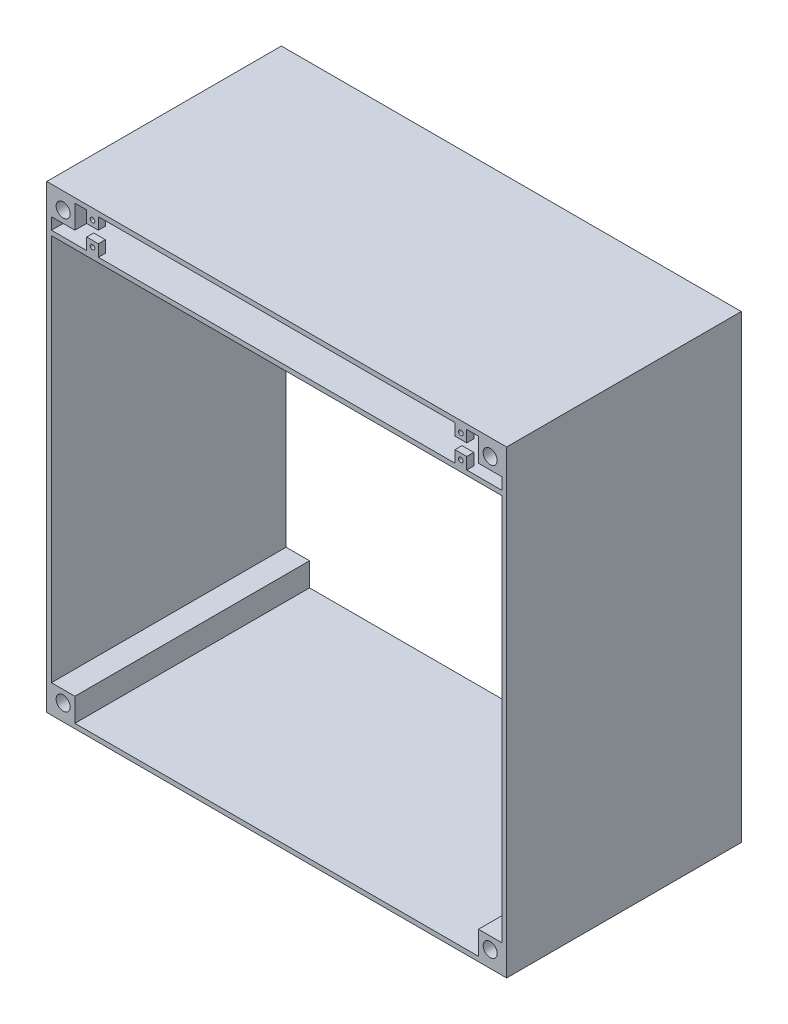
ISO-10303-21;
HEADER;
FILE_DESCRIPTION(('STEP AP214'),'2;1');
FILE_NAME('part.step','',(''),(''),'','','');
FILE_SCHEMA(('AUTOMOTIVE_DESIGN { 1 0 10303 214 1 1 1 1 }'));
ENDSEC;
DATA;
#1=APPLICATION_CONTEXT('core data for automotive mechanical design processes');
#2=APPLICATION_PROTOCOL_DEFINITION('international standard','automotive_design',2000,#1);
#3=PRODUCT_CONTEXT('',#1,'mechanical');
#4=PRODUCT('Part','Part','',(#3));
#5=PRODUCT_RELATED_PRODUCT_CATEGORY('part','',(#4));
#6=PRODUCT_DEFINITION_FORMATION('','',#4);
#7=PRODUCT_DEFINITION_CONTEXT('part definition',#1,'design');
#8=PRODUCT_DEFINITION('design','',#6,#7);
#9=PRODUCT_DEFINITION_SHAPE('','',#8);
#10=(LENGTH_UNIT() NAMED_UNIT(*) SI_UNIT(.MILLI.,.METRE.));
#11=(NAMED_UNIT(*) PLANE_ANGLE_UNIT() SI_UNIT($,.RADIAN.));
#12=(NAMED_UNIT(*) SI_UNIT($,.STERADIAN.) SOLID_ANGLE_UNIT());
#13=UNCERTAINTY_MEASURE_WITH_UNIT(LENGTH_MEASURE(1.E-05),#10,'distance_accuracy_value','');
#14=(GEOMETRIC_REPRESENTATION_CONTEXT(3) GLOBAL_UNCERTAINTY_ASSIGNED_CONTEXT((#13)) GLOBAL_UNIT_ASSIGNED_CONTEXT((#10,
#11,#12)) REPRESENTATION_CONTEXT('',''));
#15=CARTESIAN_POINT('',(0.,0.,0.));
#16=DIRECTION('',(0.,0.,1.));
#17=DIRECTION('',(1.,0.,0.));
#18=AXIS2_PLACEMENT_3D('',#15,#16,#17);
#19=CARTESIAN_POINT('',(2.54,0.,63.5));
#20=DIRECTION('',(-1.,0.,0.));
#21=DIRECTION('',(0.,0.,1.));
#22=AXIS2_PLACEMENT_3D('',#19,#20,#21);
#23=PLANE('',#22);
#24=DIRECTION('',(0.,0.,-1.));
#25=VECTOR('',#24,1.);
#26=CARTESIAN_POINT('',(2.54,233.68,63.5));
#27=LINE('',#26,#25);
#28=CARTESIAN_POINT('',(2.54,233.68,63.5));
#29=VERTEX_POINT('',#28);
#30=CARTESIAN_POINT('',(2.54,233.68,-63.5));
#31=VERTEX_POINT('',#30);
#32=EDGE_CURVE('E60',#29,#31,#27,.T.);
#33=ORIENTED_EDGE('',*,*,#32,.F.);
#34=DIRECTION('',(0.,1.,0.));
#35=VECTOR('',#34,1.);
#36=CARTESIAN_POINT('',(2.54,0.,63.5));
#37=LINE('',#36,#35);
#38=CARTESIAN_POINT('',(2.54,227.33,63.5));
#39=VERTEX_POINT('',#38);
#40=EDGE_CURVE('E372',#39,#29,#37,.T.);
#41=ORIENTED_EDGE('',*,*,#40,.F.);
#42=DIRECTION('',(0.,0.,-1.));
#43=VECTOR('',#42,1.);
#44=CARTESIAN_POINT('',(2.54,227.33,63.5));
#45=LINE('',#44,#43);
#46=CARTESIAN_POINT('',(2.54,227.33,-63.5));
#47=VERTEX_POINT('',#46);
#48=EDGE_CURVE('E785',#39,#47,#45,.T.);
#49=ORIENTED_EDGE('',*,*,#48,.T.);
#50=DIRECTION('',(0.,1.,0.));
#51=VECTOR('',#50,1.);
#52=CARTESIAN_POINT('',(2.54,0.,-63.5));
#53=LINE('',#52,#51);
#54=EDGE_CURVE('E825',#47,#31,#53,.T.);
#55=ORIENTED_EDGE('',*,*,#54,.T.);
#56=EDGE_LOOP('',(#33,#41,#49,#55));
#57=FACE_BOUND('',#56,.T.);
#58=ADVANCED_FACE('F37',(#57),#23,.F.);
#59=CARTESIAN_POINT('',(246.38,0.,63.5));
#60=DIRECTION('',(-1.,0.,0.));
#61=DIRECTION('',(0.,0.,1.));
#62=AXIS2_PLACEMENT_3D('',#59,#60,#61);
#63=PLANE('',#62);
#64=DIRECTION('',(0.,1.,0.));
#65=VECTOR('',#64,1.);
#66=CARTESIAN_POINT('',(246.38,0.,-63.5));
#67=LINE('',#66,#65);
#68=CARTESIAN_POINT('',(246.38,15.24,-63.5));
#69=VERTEX_POINT('',#68);
#70=CARTESIAN_POINT('',(246.38,224.79,-63.5));
#71=VERTEX_POINT('',#70);
#72=EDGE_CURVE('E793',#69,#71,#67,.T.);
#73=ORIENTED_EDGE('',*,*,#72,.F.);
#74=DIRECTION('',(0.,0.,-1.));
#75=VECTOR('',#74,1.);
#76=CARTESIAN_POINT('',(246.38,15.24,63.5));
#77=LINE('',#76,#75);
#78=CARTESIAN_POINT('',(246.38,15.24,63.5));
#79=VERTEX_POINT('',#78);
#80=EDGE_CURVE('E421',#79,#69,#77,.T.);
#81=ORIENTED_EDGE('',*,*,#80,.F.);
#82=DIRECTION('',(0.,1.,0.));
#83=VECTOR('',#82,1.);
#84=CARTESIAN_POINT('',(246.38,0.,63.5));
#85=LINE('',#84,#83);
#86=CARTESIAN_POINT('',(246.38,224.79,63.5));
#87=VERTEX_POINT('',#86);
#88=EDGE_CURVE('E809',#79,#87,#85,.T.);
#89=ORIENTED_EDGE('',*,*,#88,.T.);
#90=DIRECTION('',(0.,0.,-1.));
#91=VECTOR('',#90,1.);
#92=CARTESIAN_POINT('',(246.38,224.79,63.5));
#93=LINE('',#92,#91);
#94=EDGE_CURVE('E779',#87,#71,#93,.T.);
#95=ORIENTED_EDGE('',*,*,#94,.T.);
#96=EDGE_LOOP('',(#73,#81,#89,#95));
#97=FACE_BOUND('',#96,.T.);
#98=ADVANCED_FACE('F869',(#97),#63,.T.);
#99=CARTESIAN_POINT('',(0.,2.54,63.5));
#100=DIRECTION('',(0.,1.,0.));
#101=DIRECTION('',(0.,0.,1.));
#102=AXIS2_PLACEMENT_3D('',#99,#100,#101);
#103=PLANE('',#102);
#104=DIRECTION('',(0.,0.,-1.));
#105=VECTOR('',#104,1.);
#106=CARTESIAN_POINT('',(233.68,2.54,63.5));
#107=LINE('',#106,#105);
#108=CARTESIAN_POINT('',(233.68,2.54,63.5));
#109=VERTEX_POINT('',#108);
#110=CARTESIAN_POINT('',(233.68,2.54,-63.5));
#111=VERTEX_POINT('',#110);
#112=EDGE_CURVE('E409',#109,#111,#107,.T.);
#113=ORIENTED_EDGE('',*,*,#112,.T.);
#114=DIRECTION('',(1.,0.,0.));
#115=VECTOR('',#114,1.);
#116=CARTESIAN_POINT('',(0.,2.54,-63.5));
#117=LINE('',#116,#115);
#118=CARTESIAN_POINT('',(15.24,2.54,-63.5));
#119=VERTEX_POINT('',#118);
#120=EDGE_CURVE('E822',#119,#111,#117,.T.);
#121=ORIENTED_EDGE('',*,*,#120,.F.);
#122=DIRECTION('',(0.,0.,-1.));
#123=VECTOR('',#122,1.);
#124=CARTESIAN_POINT('',(15.24,2.54,63.5));
#125=LINE('',#124,#123);
#126=CARTESIAN_POINT('',(15.24,2.54,63.5));
#127=VERTEX_POINT('',#126);
#128=EDGE_CURVE('E446',#127,#119,#125,.T.);
#129=ORIENTED_EDGE('',*,*,#128,.F.);
#130=DIRECTION('',(1.,0.,0.));
#131=VECTOR('',#130,1.);
#132=CARTESIAN_POINT('',(0.,2.54,63.5));
#133=LINE('',#132,#131);
#134=EDGE_CURVE('E800',#127,#109,#133,.T.);
#135=ORIENTED_EDGE('',*,*,#134,.T.);
#136=EDGE_LOOP('',(#113,#121,#129,#135));
#137=FACE_BOUND('',#136,.T.);
#138=ADVANCED_FACE('F873',(#137),#103,.T.);
#139=CARTESIAN_POINT('',(0.,246.38,63.5));
#140=DIRECTION('',(0.,1.,0.));
#141=DIRECTION('',(0.,0.,1.));
#142=AXIS2_PLACEMENT_3D('',#139,#140,#141);
#143=PLANE('',#142);
#144=DIRECTION('',(1.,0.,0.));
#145=VECTOR('',#144,1.);
#146=CARTESIAN_POINT('',(0.,246.38,63.5));
#147=LINE('',#146,#145);
#148=CARTESIAN_POINT('',(15.24,246.38,63.5));
#149=VERTEX_POINT('',#148);
#150=CARTESIAN_POINT('',(21.59,246.38,63.5));
#151=VERTEX_POINT('',#150);
#152=EDGE_CURVE('E52',#149,#151,#147,.T.);
#153=ORIENTED_EDGE('',*,*,#152,.F.);
#154=DIRECTION('',(0.,0.,-1.));
#155=VECTOR('',#154,1.);
#156=CARTESIAN_POINT('',(15.24,246.38,63.5));
#157=LINE('',#156,#155);
#158=CARTESIAN_POINT('',(15.24,246.38,-63.5));
#159=VERTEX_POINT('',#158);
#160=EDGE_CURVE('E384',#149,#159,#157,.T.);
#161=ORIENTED_EDGE('',*,*,#160,.T.);
#162=DIRECTION('',(1.,0.,0.));
#163=VECTOR('',#162,1.);
#164=CARTESIAN_POINT('',(0.,246.38,-63.5));
#165=LINE('',#164,#163);
#166=CARTESIAN_POINT('',(21.59,246.38,-63.5));
#167=VERTEX_POINT('',#166);
#168=EDGE_CURVE('E829',#159,#167,#165,.T.);
#169=ORIENTED_EDGE('',*,*,#168,.T.);
#170=DIRECTION('',(0.,0.,-1.));
#171=VECTOR('',#170,1.);
#172=CARTESIAN_POINT('',(21.59,246.38,-59.69));
#173=LINE('',#172,#171);
#174=CARTESIAN_POINT('',(21.59,246.38,-59.69));
#175=VERTEX_POINT('',#174);
#176=EDGE_CURVE('E497',#175,#167,#173,.T.);
#177=ORIENTED_EDGE('',*,*,#176,.F.);
#178=DIRECTION('',(1.,0.,0.));
#179=VECTOR('',#178,1.);
#180=CARTESIAN_POINT('',(0.,246.38,-59.69));
#181=LINE('',#180,#179);
#182=CARTESIAN_POINT('',(27.94,246.38,-59.69));
#183=VERTEX_POINT('',#182);
#184=EDGE_CURVE('E475',#175,#183,#181,.T.);
#185=ORIENTED_EDGE('',*,*,#184,.T.);
#186=DIRECTION('',(0.,0.,-1.));
#187=VECTOR('',#186,1.);
#188=CARTESIAN_POINT('',(27.94,246.38,-59.69));
#189=LINE('',#188,#187);
#190=CARTESIAN_POINT('',(27.94,246.38,-63.5));
#191=VERTEX_POINT('',#190);
#192=EDGE_CURVE('E488',#183,#191,#189,.T.);
#193=ORIENTED_EDGE('',*,*,#192,.T.);
#194=CARTESIAN_POINT('',(220.98,246.38,-63.5));
#195=VERTEX_POINT('',#194);
#196=EDGE_CURVE('E832',#191,#195,#165,.T.);
#197=ORIENTED_EDGE('',*,*,#196,.T.);
#198=DIRECTION('',(0.,0.,-1.));
#199=VECTOR('',#198,1.);
#200=CARTESIAN_POINT('',(220.98,246.38,-59.69));
#201=LINE('',#200,#199);
#202=CARTESIAN_POINT('',(220.98,246.38,-59.69));
#203=VERTEX_POINT('',#202);
#204=EDGE_CURVE('E524',#203,#195,#201,.T.);
#205=ORIENTED_EDGE('',*,*,#204,.F.);
#206=DIRECTION('',(1.,0.,0.));
#207=VECTOR('',#206,1.);
#208=CARTESIAN_POINT('',(0.,246.38,-59.69));
#209=LINE('',#208,#207);
#210=CARTESIAN_POINT('',(227.33,246.38,-59.69));
#211=VERTEX_POINT('',#210);
#212=EDGE_CURVE('E516',#203,#211,#209,.T.);
#213=ORIENTED_EDGE('',*,*,#212,.T.);
#214=DIRECTION('',(0.,0.,-1.));
#215=VECTOR('',#214,1.);
#216=CARTESIAN_POINT('',(227.33,246.38,-59.69));
#217=LINE('',#216,#215);
#218=CARTESIAN_POINT('',(227.33,246.38,-63.5));
#219=VERTEX_POINT('',#218);
#220=EDGE_CURVE('E540',#211,#219,#217,.T.);
#221=ORIENTED_EDGE('',*,*,#220,.T.);
#222=CARTESIAN_POINT('',(233.68,246.38,-63.5));
#223=VERTEX_POINT('',#222);
#224=EDGE_CURVE('E828',#219,#223,#165,.T.);
#225=ORIENTED_EDGE('',*,*,#224,.T.);
#226=DIRECTION('',(0.,0.,-1.));
#227=VECTOR('',#226,1.);
#228=CARTESIAN_POINT('',(233.68,246.38,63.5));
#229=LINE('',#228,#227);
#230=CARTESIAN_POINT('',(233.68,246.38,63.5));
#231=VERTEX_POINT('',#230);
#232=EDGE_CURVE('E471',#231,#223,#229,.T.);
#233=ORIENTED_EDGE('',*,*,#232,.F.);
#234=CARTESIAN_POINT('',(227.33,246.38,63.5));
#235=VERTEX_POINT('',#234);
#236=EDGE_CURVE('E805',#235,#231,#147,.T.);
#237=ORIENTED_EDGE('',*,*,#236,.F.);
#238=DIRECTION('',(0.,0.,1.));
#239=VECTOR('',#238,1.);
#240=CARTESIAN_POINT('',(227.33,246.38,59.69));
#241=LINE('',#240,#239);
#242=CARTESIAN_POINT('',(227.33,246.38,59.69));
#243=VERTEX_POINT('',#242);
#244=EDGE_CURVE('E674',#243,#235,#241,.T.);
#245=ORIENTED_EDGE('',*,*,#244,.F.);
#246=DIRECTION('',(1.,0.,0.));
#247=VECTOR('',#246,1.);
#248=CARTESIAN_POINT('',(0.,246.38,59.69));
#249=LINE('',#248,#247);
#250=CARTESIAN_POINT('',(220.98,246.38,59.69));
#251=VERTEX_POINT('',#250);
#252=EDGE_CURVE('E659',#251,#243,#249,.T.);
#253=ORIENTED_EDGE('',*,*,#252,.F.);
#254=DIRECTION('',(0.,0.,1.));
#255=VECTOR('',#254,1.);
#256=CARTESIAN_POINT('',(220.98,246.38,59.69));
#257=LINE('',#256,#255);
#258=CARTESIAN_POINT('',(220.98,246.38,63.5));
#259=VERTEX_POINT('',#258);
#260=EDGE_CURVE('E670',#251,#259,#257,.T.);
#261=ORIENTED_EDGE('',*,*,#260,.T.);
#262=CARTESIAN_POINT('',(27.94,246.38,63.5));
#263=VERTEX_POINT('',#262);
#264=EDGE_CURVE('E808',#263,#259,#147,.T.);
#265=ORIENTED_EDGE('',*,*,#264,.F.);
#266=DIRECTION('',(0.,0.,1.));
#267=VECTOR('',#266,1.);
#268=CARTESIAN_POINT('',(27.94,246.38,59.69));
#269=LINE('',#268,#267);
#270=CARTESIAN_POINT('',(27.94,246.38,59.69));
#271=VERTEX_POINT('',#270);
#272=EDGE_CURVE('E640',#271,#263,#269,.T.);
#273=ORIENTED_EDGE('',*,*,#272,.F.);
#274=DIRECTION('',(1.,0.,0.));
#275=VECTOR('',#274,1.);
#276=CARTESIAN_POINT('',(0.,246.38,59.69));
#277=LINE('',#276,#275);
#278=CARTESIAN_POINT('',(21.59,246.38,59.69));
#279=VERTEX_POINT('',#278);
#280=EDGE_CURVE('E615',#279,#271,#277,.T.);
#281=ORIENTED_EDGE('',*,*,#280,.F.);
#282=DIRECTION('',(0.,0.,1.));
#283=VECTOR('',#282,1.);
#284=CARTESIAN_POINT('',(21.59,246.38,59.69));
#285=LINE('',#284,#283);
#286=EDGE_CURVE('E630',#279,#151,#285,.T.);
#287=ORIENTED_EDGE('',*,*,#286,.T.);
#288=EDGE_LOOP('',(#153,#161,#169,#177,#185,#193,#197,#205,#213,#221,#225,#233,#237,#245,#253,
#261,#265,#273,#281,#287));
#289=FACE_BOUND('',#288,.T.);
#290=ADVANCED_FACE('F879',(#289),#143,.F.);
#291=CARTESIAN_POINT('',(243.84,227.33,63.5));
#292=DIRECTION('',(0.,1.,0.));
#293=DIRECTION('',(0.,0.,1.));
#294=AXIS2_PLACEMENT_3D('',#291,#292,#293);
#295=PLANE('',#294);
#296=DIRECTION('',(0.,0.,-1.));
#297=VECTOR('',#296,1.);
#298=CARTESIAN_POINT('',(27.94,227.33,-59.69));
#299=LINE('',#298,#297);
#300=CARTESIAN_POINT('',(27.94,227.33,-59.69));
#301=VERTEX_POINT('',#300);
#302=CARTESIAN_POINT('',(27.94,227.33,-63.5));
#303=VERTEX_POINT('',#302);
#304=EDGE_CURVE('E561',#301,#303,#299,.T.);
#305=ORIENTED_EDGE('',*,*,#304,.F.);
#306=DIRECTION('',(-1.,0.,0.));
#307=VECTOR('',#306,1.);
#308=CARTESIAN_POINT('',(0.,227.33,-59.69));
#309=LINE('',#308,#307);
#310=CARTESIAN_POINT('',(21.59,227.33,-59.69));
#311=VERTEX_POINT('',#310);
#312=EDGE_CURVE('E552',#301,#311,#309,.T.);
#313=ORIENTED_EDGE('',*,*,#312,.T.);
#314=DIRECTION('',(0.,0.,-1.));
#315=VECTOR('',#314,1.);
#316=CARTESIAN_POINT('',(21.59,227.33,-59.69));
#317=LINE('',#316,#315);
#318=CARTESIAN_POINT('',(21.59,227.33,-63.5));
#319=VERTEX_POINT('',#318);
#320=EDGE_CURVE('E576',#311,#319,#317,.T.);
#321=ORIENTED_EDGE('',*,*,#320,.T.);
#322=DIRECTION('',(1.,0.,0.));
#323=VECTOR('',#322,1.);
#324=CARTESIAN_POINT('',(243.84,227.33,-63.5));
#325=LINE('',#324,#323);
#326=EDGE_CURVE('E773',#47,#319,#325,.T.);
#327=ORIENTED_EDGE('',*,*,#326,.F.);
#328=ORIENTED_EDGE('',*,*,#48,.F.);
#329=DIRECTION('',(1.,0.,0.));
#330=VECTOR('',#329,1.);
#331=CARTESIAN_POINT('',(2.54,227.33,63.5));
#332=LINE('',#331,#330);
#333=CARTESIAN_POINT('',(21.59,227.33,63.5));
#334=VERTEX_POINT('',#333);
#335=EDGE_CURVE('E766',#334,#39,#332,.F.);
#336=ORIENTED_EDGE('',*,*,#335,.F.);
#337=DIRECTION('',(0.,0.,1.));
#338=VECTOR('',#337,1.);
#339=CARTESIAN_POINT('',(21.59,227.33,59.69));
#340=LINE('',#339,#338);
#341=CARTESIAN_POINT('',(21.59,227.33,59.69));
#342=VERTEX_POINT('',#341);
#343=EDGE_CURVE('E706',#342,#334,#340,.T.);
#344=ORIENTED_EDGE('',*,*,#343,.F.);
#345=DIRECTION('',(-1.,0.,0.));
#346=VECTOR('',#345,1.);
#347=CARTESIAN_POINT('',(0.,227.33,59.69));
#348=LINE('',#347,#346);
#349=CARTESIAN_POINT('',(27.94,227.33,59.69));
#350=VERTEX_POINT('',#349);
#351=EDGE_CURVE('E692',#350,#342,#348,.T.);
#352=ORIENTED_EDGE('',*,*,#351,.F.);
#353=DIRECTION('',(0.,0.,1.));
#354=VECTOR('',#353,1.);
#355=CARTESIAN_POINT('',(27.94,227.33,59.69));
#356=LINE('',#355,#354);
#357=CARTESIAN_POINT('',(27.94,227.33,63.5));
#358=VERTEX_POINT('',#357);
#359=EDGE_CURVE('E702',#350,#358,#356,.T.);
#360=ORIENTED_EDGE('',*,*,#359,.T.);
#361=CARTESIAN_POINT('',(220.98,227.33,63.5));
#362=VERTEX_POINT('',#361);
#363=EDGE_CURVE('E765',#362,#358,#332,.F.);
#364=ORIENTED_EDGE('',*,*,#363,.F.);
#365=DIRECTION('',(0.,0.,1.));
#366=VECTOR('',#365,1.);
#367=CARTESIAN_POINT('',(220.98,227.33,59.69));
#368=LINE('',#367,#366);
#369=CARTESIAN_POINT('',(220.98,227.33,59.69));
#370=VERTEX_POINT('',#369);
#371=EDGE_CURVE('E739',#370,#362,#368,.T.);
#372=ORIENTED_EDGE('',*,*,#371,.F.);
#373=DIRECTION('',(-1.,0.,0.));
#374=VECTOR('',#373,1.);
#375=CARTESIAN_POINT('',(0.,227.33,59.69));
#376=LINE('',#375,#374);
#377=CARTESIAN_POINT('',(227.33,227.33,59.69));
#378=VERTEX_POINT('',#377);
#379=EDGE_CURVE('E714',#378,#370,#376,.T.);
#380=ORIENTED_EDGE('',*,*,#379,.F.);
#381=DIRECTION('',(0.,0.,1.));
#382=VECTOR('',#381,1.);
#383=CARTESIAN_POINT('',(227.33,227.33,59.69));
#384=LINE('',#383,#382);
#385=CARTESIAN_POINT('',(227.33,227.33,63.5));
#386=VERTEX_POINT('',#385);
#387=EDGE_CURVE('E729',#378,#386,#384,.T.);
#388=ORIENTED_EDGE('',*,*,#387,.T.);
#389=CARTESIAN_POINT('',(246.38,227.33,63.5));
#390=VERTEX_POINT('',#389);
#391=EDGE_CURVE('E761',#390,#386,#332,.F.);
#392=ORIENTED_EDGE('',*,*,#391,.F.);
#393=DIRECTION('',(0.,0.,-1.));
#394=VECTOR('',#393,1.);
#395=CARTESIAN_POINT('',(246.38,227.33,63.5));
#396=LINE('',#395,#394);
#397=CARTESIAN_POINT('',(246.38,227.33,-63.5));
#398=VERTEX_POINT('',#397);
#399=EDGE_CURVE('E769',#390,#398,#396,.T.);
#400=ORIENTED_EDGE('',*,*,#399,.T.);
#401=CARTESIAN_POINT('',(227.33,227.33,-63.5));
#402=VERTEX_POINT('',#401);
#403=EDGE_CURVE('E772',#402,#398,#325,.T.);
#404=ORIENTED_EDGE('',*,*,#403,.F.);
#405=DIRECTION('',(0.,0.,-1.));
#406=VECTOR('',#405,1.);
#407=CARTESIAN_POINT('',(227.33,227.33,-59.69));
#408=LINE('',#407,#406);
#409=CARTESIAN_POINT('',(227.33,227.33,-59.69));
#410=VERTEX_POINT('',#409);
#411=EDGE_CURVE('E603',#410,#402,#408,.T.);
#412=ORIENTED_EDGE('',*,*,#411,.F.);
#413=DIRECTION('',(-1.,0.,0.));
#414=VECTOR('',#413,1.);
#415=CARTESIAN_POINT('',(0.,227.33,-59.69));
#416=LINE('',#415,#414);
#417=CARTESIAN_POINT('',(220.98,227.33,-59.69));
#418=VERTEX_POINT('',#417);
#419=EDGE_CURVE('E581',#410,#418,#416,.T.);
#420=ORIENTED_EDGE('',*,*,#419,.T.);
#421=DIRECTION('',(0.,0.,-1.));
#422=VECTOR('',#421,1.);
#423=CARTESIAN_POINT('',(220.98,227.33,-59.69));
#424=LINE('',#423,#422);
#425=CARTESIAN_POINT('',(220.98,227.33,-63.5));
#426=VERTEX_POINT('',#425);
#427=EDGE_CURVE('E594',#418,#426,#424,.T.);
#428=ORIENTED_EDGE('',*,*,#427,.T.);
#429=EDGE_CURVE('E776',#303,#426,#325,.T.);
#430=ORIENTED_EDGE('',*,*,#429,.F.);
#431=EDGE_LOOP('',(#305,#313,#321,#327,#328,#336,#344,#352,#360,#364,#372,#380,#388,#392,#400,
#404,#412,#420,#428,#430));
#432=FACE_BOUND('',#431,.T.);
#433=CARTESIAN_POINT('',(63.5,227.33,0.));
#434=DIRECTION('',(0.,-1.,0.));
#435=DIRECTION('',(0.,0.,-1.));
#436=AXIS2_PLACEMENT_3D('',#433,#434,#435);
#437=CIRCLE('',#436,6.35);
#438=CARTESIAN_POINT('',(63.5,227.33,-6.35));
#439=VERTEX_POINT('',#438);
#440=EDGE_CURVE('E749',#439,#439,#437,.T.);
#441=ORIENTED_EDGE('',*,*,#440,.T.);
#442=EDGE_LOOP('',(#441));
#443=FACE_BOUND('',#442,.T.);
#444=CARTESIAN_POINT('',(185.42,227.33,0.));
#445=DIRECTION('',(0.,-1.,0.));
#446=DIRECTION('',(0.,0.,-1.));
#447=AXIS2_PLACEMENT_3D('',#444,#445,#446);
#448=CIRCLE('',#447,6.35);
#449=CARTESIAN_POINT('',(185.42,227.33,-6.35));
#450=VERTEX_POINT('',#449);
#451=EDGE_CURVE('E742',#450,#450,#448,.T.);
#452=ORIENTED_EDGE('',*,*,#451,.T.);
#453=EDGE_LOOP('',(#452));
#454=FACE_BOUND('',#453,.T.);
#455=ADVANCED_FACE('F865',(#432,#443,#454),#295,.T.);
#456=CARTESIAN_POINT('',(2.54,15.24,63.5));
#457=VERTEX_POINT('',#456);
#458=CARTESIAN_POINT('',(2.54,224.79,63.5));
#459=VERTEX_POINT('',#458);
#460=EDGE_CURVE('E803',#457,#459,#37,.T.);
#461=ORIENTED_EDGE('',*,*,#460,.F.);
#462=DIRECTION('',(0.,0.,-1.));
#463=VECTOR('',#462,1.);
#464=CARTESIAN_POINT('',(2.54,15.24,63.5));
#465=LINE('',#464,#463);
#466=CARTESIAN_POINT('',(2.54,15.24,-63.5));
#467=VERTEX_POINT('',#466);
#468=EDGE_CURVE('E434',#457,#467,#465,.T.);
#469=ORIENTED_EDGE('',*,*,#468,.T.);
#470=CARTESIAN_POINT('',(2.54,224.79,-63.5));
#471=VERTEX_POINT('',#470);
#472=EDGE_CURVE('E826',#467,#471,#53,.T.);
#473=ORIENTED_EDGE('',*,*,#472,.T.);
#474=DIRECTION('',(0.,0.,-1.));
#475=VECTOR('',#474,1.);
#476=CARTESIAN_POINT('',(2.54,224.79,63.5));
#477=LINE('',#476,#475);
#478=EDGE_CURVE('E782',#459,#471,#477,.T.);
#479=ORIENTED_EDGE('',*,*,#478,.F.);
#480=EDGE_LOOP('',(#461,#469,#473,#479));
#481=FACE_BOUND('',#480,.T.);
#482=ADVANCED_FACE('F860',(#481),#23,.F.);
#483=CARTESIAN_POINT('',(0.,0.,63.5));
#484=DIRECTION('',(-1.,0.,0.));
#485=DIRECTION('',(0.,0.,1.));
#486=AXIS2_PLACEMENT_3D('',#483,#484,#485);
#487=PLANE('',#486);
#488=DIRECTION('',(0.,1.,0.));
#489=VECTOR('',#488,1.);
#490=CARTESIAN_POINT('',(0.,0.,-63.5));
#491=LINE('',#490,#489);
#492=CARTESIAN_POINT('',(0.,0.,-63.5));
#493=VERTEX_POINT('',#492);
#494=CARTESIAN_POINT('',(0.,248.92,-63.5));
#495=VERTEX_POINT('',#494);
#496=EDGE_CURVE('E788',#493,#495,#491,.T.);
#497=ORIENTED_EDGE('',*,*,#496,.F.);
#498=DIRECTION('',(0.,0.,-1.));
#499=VECTOR('',#498,1.);
#500=CARTESIAN_POINT('',(0.,0.,63.5));
#501=LINE('',#500,#499);
#502=CARTESIAN_POINT('',(0.,0.,63.5));
#503=VERTEX_POINT('',#502);
#504=EDGE_CURVE('E11',#503,#493,#501,.T.);
#505=ORIENTED_EDGE('',*,*,#504,.F.);
#506=DIRECTION('',(0.,1.,0.));
#507=VECTOR('',#506,1.);
#508=CARTESIAN_POINT('',(0.,0.,63.5));
#509=LINE('',#508,#507);
#510=CARTESIAN_POINT('',(0.,248.92,63.5));
#511=VERTEX_POINT('',#510);
#512=EDGE_CURVE('E789',#503,#511,#509,.T.);
#513=ORIENTED_EDGE('',*,*,#512,.T.);
#514=DIRECTION('',(0.,0.,-1.));
#515=VECTOR('',#514,1.);
#516=CARTESIAN_POINT('',(0.,248.92,63.5));
#517=LINE('',#516,#515);
#518=EDGE_CURVE('E811',#511,#495,#517,.T.);
#519=ORIENTED_EDGE('',*,*,#518,.T.);
#520=EDGE_LOOP('',(#497,#505,#513,#519));
#521=FACE_BOUND('',#520,.T.);
#522=ADVANCED_FACE('F39',(#521),#487,.T.);
#523=CARTESIAN_POINT('',(0.,0.,63.5));
#524=DIRECTION('',(0.,1.,0.));
#525=DIRECTION('',(0.,0.,1.));
#526=AXIS2_PLACEMENT_3D('',#523,#524,#525);
#527=PLANE('',#526);
#528=DIRECTION('',(1.,0.,0.));
#529=VECTOR('',#528,1.);
#530=CARTESIAN_POINT('',(0.,0.,-63.5));
#531=LINE('',#530,#529);
#532=CARTESIAN_POINT('',(248.92,0.,-63.5));
#533=VERTEX_POINT('',#532);
#534=EDGE_CURVE('E814',#493,#533,#531,.T.);
#535=ORIENTED_EDGE('',*,*,#534,.T.);
#536=DIRECTION('',(0.,0.,-1.));
#537=VECTOR('',#536,1.);
#538=CARTESIAN_POINT('',(248.92,0.,63.5));
#539=LINE('',#538,#537);
#540=CARTESIAN_POINT('',(248.92,0.,63.5));
#541=VERTEX_POINT('',#540);
#542=EDGE_CURVE('E45',#541,#533,#539,.T.);
#543=ORIENTED_EDGE('',*,*,#542,.F.);
#544=DIRECTION('',(1.,0.,0.));
#545=VECTOR('',#544,1.);
#546=CARTESIAN_POINT('',(0.,0.,63.5));
#547=LINE('',#546,#545);
#548=EDGE_CURVE('E792',#503,#541,#547,.T.);
#549=ORIENTED_EDGE('',*,*,#548,.F.);
#550=ORIENTED_EDGE('',*,*,#504,.T.);
#551=EDGE_LOOP('',(#535,#543,#549,#550));
#552=FACE_BOUND('',#551,.T.);
#553=ADVANCED_FACE('F857',(#552),#527,.F.);
#554=CARTESIAN_POINT('',(248.92,0.,63.5));
#555=DIRECTION('',(-1.,0.,0.));
#556=DIRECTION('',(0.,0.,1.));
#557=AXIS2_PLACEMENT_3D('',#554,#555,#556);
#558=PLANE('',#557);
#559=DIRECTION('',(0.,1.,0.));
#560=VECTOR('',#559,1.);
#561=CARTESIAN_POINT('',(248.92,0.,-63.5));
#562=LINE('',#561,#560);
#563=CARTESIAN_POINT('',(248.92,248.92,-63.5));
#564=VERTEX_POINT('',#563);
#565=EDGE_CURVE('E816',#533,#564,#562,.T.);
#566=ORIENTED_EDGE('',*,*,#565,.T.);
#567=DIRECTION('',(0.,0.,-1.));
#568=VECTOR('',#567,1.);
#569=CARTESIAN_POINT('',(248.92,248.92,63.5));
#570=LINE('',#569,#568);
#571=CARTESIAN_POINT('',(248.92,248.92,63.5));
#572=VERTEX_POINT('',#571);
#573=EDGE_CURVE('E835',#572,#564,#570,.T.);
#574=ORIENTED_EDGE('',*,*,#573,.F.);
#575=DIRECTION('',(0.,1.,0.));
#576=VECTOR('',#575,1.);
#577=CARTESIAN_POINT('',(248.92,0.,63.5));
#578=LINE('',#577,#576);
#579=EDGE_CURVE('E795',#541,#572,#578,.T.);
#580=ORIENTED_EDGE('',*,*,#579,.F.);
#581=ORIENTED_EDGE('',*,*,#542,.T.);
#582=EDGE_LOOP('',(#566,#574,#580,#581));
#583=FACE_BOUND('',#582,.T.);
#584=ADVANCED_FACE('F841',(#583),#558,.F.);
#585=CARTESIAN_POINT('',(0.,248.92,63.5));
#586=DIRECTION('',(0.,1.,0.));
#587=DIRECTION('',(0.,0.,1.));
#588=AXIS2_PLACEMENT_3D('',#585,#586,#587);
#589=PLANE('',#588);
#590=DIRECTION('',(1.,0.,0.));
#591=VECTOR('',#590,1.);
#592=CARTESIAN_POINT('',(0.,248.92,-63.5));
#593=LINE('',#592,#591);
#594=EDGE_CURVE('E819',#495,#564,#593,.T.);
#595=ORIENTED_EDGE('',*,*,#594,.F.);
#596=ORIENTED_EDGE('',*,*,#518,.F.);
#597=DIRECTION('',(1.,0.,0.));
#598=VECTOR('',#597,1.);
#599=CARTESIAN_POINT('',(0.,248.92,63.5));
#600=LINE('',#599,#598);
#601=EDGE_CURVE('E797',#511,#572,#600,.T.);
#602=ORIENTED_EDGE('',*,*,#601,.T.);
#603=ORIENTED_EDGE('',*,*,#573,.T.);
#604=EDGE_LOOP('',(#595,#596,#602,#603));
#605=FACE_BOUND('',#604,.T.);
#606=ADVANCED_FACE('F852',(#605),#589,.T.);
#607=DIRECTION('',(0.,0.,-1.));
#608=VECTOR('',#607,1.);
#609=CARTESIAN_POINT('',(246.38,233.68,63.5));
#610=LINE('',#609,#608);
#611=CARTESIAN_POINT('',(246.38,233.68,63.5));
#612=VERTEX_POINT('',#611);
#613=CARTESIAN_POINT('',(246.38,233.68,-63.5));
#614=VERTEX_POINT('',#613);
#615=EDGE_CURVE('E459',#612,#614,#610,.T.);
#616=ORIENTED_EDGE('',*,*,#615,.T.);
#617=EDGE_CURVE('E831',#398,#614,#67,.T.);
#618=ORIENTED_EDGE('',*,*,#617,.F.);
#619=ORIENTED_EDGE('',*,*,#399,.F.);
#620=EDGE_CURVE('E807',#390,#612,#85,.T.);
#621=ORIENTED_EDGE('',*,*,#620,.T.);
#622=EDGE_LOOP('',(#616,#618,#619,#621));
#623=FACE_BOUND('',#622,.T.);
#624=ADVANCED_FACE('F876',(#623),#63,.T.);
#625=CARTESIAN_POINT('',(0.,0.,63.5));
#626=DIRECTION('',(0.,0.,1.));
#627=DIRECTION('',(1.,0.,0.));
#628=AXIS2_PLACEMENT_3D('',#625,#626,#627);
#629=PLANE('',#628);
#630=DIRECTION('',(0.,-1.,0.));
#631=VECTOR('',#630,1.);
#632=CARTESIAN_POINT('',(15.24,0.,63.5));
#633=LINE('',#632,#631);
#634=CARTESIAN_POINT('',(15.24,233.68,63.5));
#635=VERTEX_POINT('',#634);
#636=EDGE_CURVE('E371',#149,#635,#633,.T.);
#637=ORIENTED_EDGE('',*,*,#636,.F.);
#638=ORIENTED_EDGE('',*,*,#152,.T.);
#639=DIRECTION('',(0.,-1.,0.));
#640=VECTOR('',#639,1.);
#641=CARTESIAN_POINT('',(21.59,0.,63.5));
#642=LINE('',#641,#640);
#643=CARTESIAN_POINT('',(21.59,240.03,63.5));
#644=VERTEX_POINT('',#643);
#645=EDGE_CURVE('E606',#151,#644,#642,.T.);
#646=ORIENTED_EDGE('',*,*,#645,.T.);
#647=DIRECTION('',(1.,0.,0.));
#648=VECTOR('',#647,1.);
#649=CARTESIAN_POINT('',(0.,240.03,63.5));
#650=LINE('',#649,#648);
#651=CARTESIAN_POINT('',(27.94,240.03,63.5));
#652=VERTEX_POINT('',#651);
#653=EDGE_CURVE('E633',#644,#652,#650,.T.);
#654=ORIENTED_EDGE('',*,*,#653,.T.);
#655=DIRECTION('',(0.,1.,0.));
#656=VECTOR('',#655,1.);
#657=CARTESIAN_POINT('',(27.94,0.,63.5));
#658=LINE('',#657,#656);
#659=EDGE_CURVE('E636',#652,#263,#658,.T.);
#660=ORIENTED_EDGE('',*,*,#659,.T.);
#661=ORIENTED_EDGE('',*,*,#264,.T.);
#662=DIRECTION('',(0.,1.,0.));
#663=VECTOR('',#662,1.);
#664=CARTESIAN_POINT('',(220.98,0.,63.5));
#665=LINE('',#664,#663);
#666=CARTESIAN_POINT('',(220.98,240.03,63.5));
#667=VERTEX_POINT('',#666);
#668=EDGE_CURVE('E664',#667,#259,#665,.T.);
#669=ORIENTED_EDGE('',*,*,#668,.F.);
#670=DIRECTION('',(-1.,0.,0.));
#671=VECTOR('',#670,1.);
#672=CARTESIAN_POINT('',(0.,240.03,63.5));
#673=LINE('',#672,#671);
#674=CARTESIAN_POINT('',(227.33,240.03,63.5));
#675=VERTEX_POINT('',#674);
#676=EDGE_CURVE('E667',#675,#667,#673,.T.);
#677=ORIENTED_EDGE('',*,*,#676,.F.);
#678=DIRECTION('',(0.,-1.,0.));
#679=VECTOR('',#678,1.);
#680=CARTESIAN_POINT('',(227.33,0.,63.5));
#681=LINE('',#680,#679);
#682=EDGE_CURVE('E653',#235,#675,#681,.T.);
#683=ORIENTED_EDGE('',*,*,#682,.F.);
#684=ORIENTED_EDGE('',*,*,#236,.T.);
#685=DIRECTION('',(0.,-1.,0.));
#686=VECTOR('',#685,1.);
#687=CARTESIAN_POINT('',(233.68,0.,63.5));
#688=LINE('',#687,#686);
#689=CARTESIAN_POINT('',(233.68,233.68,63.5));
#690=VERTEX_POINT('',#689);
#691=EDGE_CURVE('E453',#231,#690,#688,.T.);
#692=ORIENTED_EDGE('',*,*,#691,.T.);
#693=DIRECTION('',(-1.,0.,0.));
#694=VECTOR('',#693,1.);
#695=CARTESIAN_POINT('',(0.,233.68,63.5));
#696=LINE('',#695,#694);
#697=EDGE_CURVE('E456',#612,#690,#696,.T.);
#698=ORIENTED_EDGE('',*,*,#697,.F.);
#699=ORIENTED_EDGE('',*,*,#620,.F.);
#700=ORIENTED_EDGE('',*,*,#391,.T.);
#701=DIRECTION('',(0.,1.,0.));
#702=VECTOR('',#701,1.);
#703=CARTESIAN_POINT('',(227.33,0.,63.5));
#704=LINE('',#703,#702);
#705=CARTESIAN_POINT('',(227.33,233.68,63.5));
#706=VERTEX_POINT('',#705);
#707=EDGE_CURVE('E705',#386,#706,#704,.T.);
#708=ORIENTED_EDGE('',*,*,#707,.T.);
#709=DIRECTION('',(-1.,0.,0.));
#710=VECTOR('',#709,1.);
#711=CARTESIAN_POINT('',(0.,233.68,63.5));
#712=LINE('',#711,#710);
#713=CARTESIAN_POINT('',(220.98,233.68,63.5));
#714=VERTEX_POINT('',#713);
#715=EDGE_CURVE('E732',#706,#714,#712,.T.);
#716=ORIENTED_EDGE('',*,*,#715,.T.);
#717=DIRECTION('',(0.,-1.,0.));
#718=VECTOR('',#717,1.);
#719=CARTESIAN_POINT('',(220.98,0.,63.5));
#720=LINE('',#719,#718);
#721=EDGE_CURVE('E735',#714,#362,#720,.T.);
#722=ORIENTED_EDGE('',*,*,#721,.T.);
#723=ORIENTED_EDGE('',*,*,#363,.T.);
#724=DIRECTION('',(0.,-1.,0.));
#725=VECTOR('',#724,1.);
#726=CARTESIAN_POINT('',(27.94,0.,63.5));
#727=LINE('',#726,#725);
#728=CARTESIAN_POINT('',(27.94,233.68,63.5));
#729=VERTEX_POINT('',#728);
#730=EDGE_CURVE('E697',#729,#358,#727,.T.);
#731=ORIENTED_EDGE('',*,*,#730,.F.);
#732=DIRECTION('',(1.,0.,0.));
#733=VECTOR('',#732,1.);
#734=CARTESIAN_POINT('',(0.,233.68,63.5));
#735=LINE('',#734,#733);
#736=CARTESIAN_POINT('',(21.59,233.68,63.5));
#737=VERTEX_POINT('',#736);
#738=EDGE_CURVE('E699',#737,#729,#735,.T.);
#739=ORIENTED_EDGE('',*,*,#738,.F.);
#740=DIRECTION('',(0.,1.,0.));
#741=VECTOR('',#740,1.);
#742=CARTESIAN_POINT('',(21.59,0.,63.5));
#743=LINE('',#742,#741);
#744=EDGE_CURVE('E686',#334,#737,#743,.T.);
#745=ORIENTED_EDGE('',*,*,#744,.F.);
#746=ORIENTED_EDGE('',*,*,#335,.T.);
#747=ORIENTED_EDGE('',*,*,#40,.T.);
#748=DIRECTION('',(1.,0.,0.));
#749=VECTOR('',#748,1.);
#750=CARTESIAN_POINT('',(0.,233.68,63.5));
#751=LINE('',#750,#749);
#752=EDGE_CURVE('E366',#29,#635,#751,.T.);
#753=ORIENTED_EDGE('',*,*,#752,.T.);
#754=EDGE_LOOP('',(#637,#638,#646,#654,#660,#661,#669,#677,#683,#684,#692,#698,#699,#700,#708,
#716,#722,#723,#731,#739,#745,#746,#747,#753));
#755=FACE_BOUND('',#754,.T.);
#756=DIRECTION('',(0.,1.,0.));
#757=VECTOR('',#756,1.);
#758=CARTESIAN_POINT('',(233.68,0.,63.5));
#759=LINE('',#758,#757);
#760=CARTESIAN_POINT('',(233.68,15.24,63.5));
#761=VERTEX_POINT('',#760);
#762=EDGE_CURVE('E402',#109,#761,#759,.T.);
#763=ORIENTED_EDGE('',*,*,#762,.F.);
#764=ORIENTED_EDGE('',*,*,#134,.F.);
#765=DIRECTION('',(0.,1.,0.));
#766=VECTOR('',#765,1.);
#767=CARTESIAN_POINT('',(15.24,0.,63.5));
#768=LINE('',#767,#766);
#769=CARTESIAN_POINT('',(15.24,15.24,63.5));
#770=VERTEX_POINT('',#769);
#771=EDGE_CURVE('E428',#127,#770,#768,.T.);
#772=ORIENTED_EDGE('',*,*,#771,.T.);
#773=DIRECTION('',(1.,0.,0.));
#774=VECTOR('',#773,1.);
#775=CARTESIAN_POINT('',(0.,15.24,63.5));
#776=LINE('',#775,#774);
#777=EDGE_CURVE('E431',#457,#770,#776,.T.);
#778=ORIENTED_EDGE('',*,*,#777,.F.);
#779=ORIENTED_EDGE('',*,*,#460,.T.);
#780=DIRECTION('',(-1.,0.,0.));
#781=VECTOR('',#780,1.);
#782=CARTESIAN_POINT('',(2.54,224.79,63.5));
#783=LINE('',#782,#781);
#784=EDGE_CURVE('E764',#87,#459,#783,.T.);
#785=ORIENTED_EDGE('',*,*,#784,.F.);
#786=ORIENTED_EDGE('',*,*,#88,.F.);
#787=DIRECTION('',(-1.,0.,0.));
#788=VECTOR('',#787,1.);
#789=CARTESIAN_POINT('',(0.,15.24,63.5));
#790=LINE('',#789,#788);
#791=EDGE_CURVE('E400',#79,#761,#790,.T.);
#792=ORIENTED_EDGE('',*,*,#791,.T.);
#793=EDGE_LOOP('',(#763,#764,#772,#778,#779,#785,#786,#792));
#794=FACE_BOUND('',#793,.T.);
#795=ORIENTED_EDGE('',*,*,#512,.F.);
#796=ORIENTED_EDGE('',*,*,#548,.T.);
#797=ORIENTED_EDGE('',*,*,#579,.T.);
#798=ORIENTED_EDGE('',*,*,#601,.F.);
#799=EDGE_LOOP('',(#795,#796,#797,#798));
#800=FACE_BOUND('',#799,.T.);
#801=CARTESIAN_POINT('',(224.155,230.505,63.5));
#802=DIRECTION('',(0.,0.,1.));
#803=DIRECTION('',(1.,0.,0.));
#804=AXIS2_PLACEMENT_3D('',#801,#802,#803);
#805=CIRCLE('',#804,1.27000000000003);
#806=CARTESIAN_POINT('',(225.425,230.505,63.5));
#807=VERTEX_POINT('',#806);
#808=EDGE_CURVE('E717',#807,#807,#805,.F.);
#809=ORIENTED_EDGE('',*,*,#808,.T.);
#810=EDGE_LOOP('',(#809));
#811=FACE_BOUND('',#810,.T.);
#812=CARTESIAN_POINT('',(24.765,230.505,63.5));
#813=DIRECTION('',(0.,0.,1.));
#814=DIRECTION('',(1.,0.,0.));
#815=AXIS2_PLACEMENT_3D('',#812,#813,#814);
#816=CIRCLE('',#815,1.27000000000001);
#817=CARTESIAN_POINT('',(26.035,230.505,63.5));
#818=VERTEX_POINT('',#817);
#819=EDGE_CURVE('E673',#818,#818,#816,.T.);
#820=ORIENTED_EDGE('',*,*,#819,.F.);
#821=EDGE_LOOP('',(#820));
#822=FACE_BOUND('',#821,.T.);
#823=CARTESIAN_POINT('',(224.155,243.205,63.5));
#824=DIRECTION('',(0.,0.,1.));
#825=DIRECTION('',(1.,0.,0.));
#826=AXIS2_PLACEMENT_3D('',#823,#824,#825);
#827=CIRCLE('',#826,1.27000000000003);
#828=CARTESIAN_POINT('',(225.425,243.205,63.5));
#829=VERTEX_POINT('',#828);
#830=EDGE_CURVE('E643',#829,#829,#827,.T.);
#831=ORIENTED_EDGE('',*,*,#830,.F.);
#832=EDGE_LOOP('',(#831));
#833=FACE_BOUND('',#832,.T.);
#834=CARTESIAN_POINT('',(24.765,243.205,63.5));
#835=DIRECTION('',(0.,0.,1.));
#836=DIRECTION('',(1.,0.,0.));
#837=AXIS2_PLACEMENT_3D('',#834,#835,#836);
#838=CIRCLE('',#837,1.27000000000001);
#839=CARTESIAN_POINT('',(26.035,243.205,63.5));
#840=VERTEX_POINT('',#839);
#841=EDGE_CURVE('E618',#840,#840,#838,.F.);
#842=ORIENTED_EDGE('',*,*,#841,.T.);
#843=EDGE_LOOP('',(#842));
#844=FACE_BOUND('',#843,.T.);
#845=CARTESIAN_POINT('',(240.03,240.03,63.5));
#846=DIRECTION('',(0.,0.,1.));
#847=DIRECTION('',(1.,0.,0.));
#848=AXIS2_PLACEMENT_3D('',#845,#846,#847);
#849=CIRCLE('',#848,3.81000000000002);
#850=CARTESIAN_POINT('',(243.84,240.03,63.5));
#851=VERTEX_POINT('',#850);
#852=EDGE_CURVE('E450',#851,#851,#849,.T.);
#853=ORIENTED_EDGE('',*,*,#852,.F.);
#854=EDGE_LOOP('',(#853));
#855=FACE_BOUND('',#854,.T.);
#856=CARTESIAN_POINT('',(8.89,8.89,63.5));
#857=DIRECTION('',(0.,0.,1.));
#858=DIRECTION('',(1.,0.,0.));
#859=AXIS2_PLACEMENT_3D('',#856,#857,#858);
#860=CIRCLE('',#859,3.81);
#861=CARTESIAN_POINT('',(12.7,8.89,63.5));
#862=VERTEX_POINT('',#861);
#863=EDGE_CURVE('E425',#862,#862,#860,.T.);
#864=ORIENTED_EDGE('',*,*,#863,.F.);
#865=EDGE_LOOP('',(#864));
#866=FACE_BOUND('',#865,.T.);
#867=CARTESIAN_POINT('',(240.03,8.89,63.5));
#868=DIRECTION('',(0.,0.,1.));
#869=DIRECTION('',(1.,0.,0.));
#870=AXIS2_PLACEMENT_3D('',#867,#868,#869);
#871=CIRCLE('',#870,3.81000000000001);
#872=CARTESIAN_POINT('',(243.84,8.89,63.5));
#873=VERTEX_POINT('',#872);
#874=EDGE_CURVE('E406',#873,#873,#871,.F.);
#875=ORIENTED_EDGE('',*,*,#874,.T.);
#876=EDGE_LOOP('',(#875));
#877=FACE_BOUND('',#876,.T.);
#878=CARTESIAN_POINT('',(8.89,240.03,63.5));
#879=DIRECTION('',(0.,0.,1.));
#880=DIRECTION('',(1.,0.,0.));
#881=AXIS2_PLACEMENT_3D('',#878,#879,#880);
#882=CIRCLE('',#881,3.81);
#883=CARTESIAN_POINT('',(12.7,240.03,63.5));
#884=VERTEX_POINT('',#883);
#885=EDGE_CURVE('E387',#884,#884,#882,.F.);
#886=ORIENTED_EDGE('',*,*,#885,.T.);
#887=EDGE_LOOP('',(#886));
#888=FACE_BOUND('',#887,.T.);
#889=ADVANCED_FACE('F368',(#755,#794,#800,#811,#822,#833,#844,#855,#866,#877,#888),#629,.T.);
#890=CARTESIAN_POINT('',(0.,0.,-63.5));
#891=DIRECTION('',(0.,0.,1.));
#892=DIRECTION('',(1.,0.,0.));
#893=AXIS2_PLACEMENT_3D('',#890,#891,#892);
#894=PLANE('',#893);
#895=ORIENTED_EDGE('',*,*,#168,.F.);
#896=DIRECTION('',(0.,-1.,0.));
#897=VECTOR('',#896,1.);
#898=CARTESIAN_POINT('',(15.24,0.,-63.5));
#899=LINE('',#898,#897);
#900=CARTESIAN_POINT('',(15.24,233.68,-63.5));
#901=VERTEX_POINT('',#900);
#902=EDGE_CURVE('E393',#159,#901,#899,.T.);
#903=ORIENTED_EDGE('',*,*,#902,.T.);
#904=DIRECTION('',(1.,0.,0.));
#905=VECTOR('',#904,1.);
#906=CARTESIAN_POINT('',(0.,233.68,-63.5));
#907=LINE('',#906,#905);
#908=EDGE_CURVE('E380',#31,#901,#907,.T.);
#909=ORIENTED_EDGE('',*,*,#908,.F.);
#910=ORIENTED_EDGE('',*,*,#54,.F.);
#911=ORIENTED_EDGE('',*,*,#326,.T.);
#912=DIRECTION('',(0.,1.,0.));
#913=VECTOR('',#912,1.);
#914=CARTESIAN_POINT('',(21.59,0.,-63.5));
#915=LINE('',#914,#913);
#916=CARTESIAN_POINT('',(21.59,233.68,-63.5));
#917=VERTEX_POINT('',#916);
#918=EDGE_CURVE('E566',#319,#917,#915,.T.);
#919=ORIENTED_EDGE('',*,*,#918,.T.);
#920=DIRECTION('',(1.,0.,0.));
#921=VECTOR('',#920,1.);
#922=CARTESIAN_POINT('',(0.,233.68,-63.5));
#923=LINE('',#922,#921);
#924=CARTESIAN_POINT('',(27.94,233.68,-63.5));
#925=VERTEX_POINT('',#924);
#926=EDGE_CURVE('E549',#917,#925,#923,.T.);
#927=ORIENTED_EDGE('',*,*,#926,.T.);
#928=DIRECTION('',(0.,-1.,0.));
#929=VECTOR('',#928,1.);
#930=CARTESIAN_POINT('',(27.94,0.,-63.5));
#931=LINE('',#930,#929);
#932=EDGE_CURVE('E564',#925,#303,#931,.T.);
#933=ORIENTED_EDGE('',*,*,#932,.T.);
#934=ORIENTED_EDGE('',*,*,#429,.T.);
#935=DIRECTION('',(0.,-1.,0.));
#936=VECTOR('',#935,1.);
#937=CARTESIAN_POINT('',(220.98,0.,-63.5));
#938=LINE('',#937,#936);
#939=CARTESIAN_POINT('',(220.98,233.68,-63.5));
#940=VERTEX_POINT('',#939);
#941=EDGE_CURVE('E573',#940,#426,#938,.T.);
#942=ORIENTED_EDGE('',*,*,#941,.F.);
#943=DIRECTION('',(-1.,0.,0.));
#944=VECTOR('',#943,1.);
#945=CARTESIAN_POINT('',(0.,233.68,-63.5));
#946=LINE('',#945,#944);
#947=CARTESIAN_POINT('',(227.33,233.68,-63.5));
#948=VERTEX_POINT('',#947);
#949=EDGE_CURVE('E597',#948,#940,#946,.T.);
#950=ORIENTED_EDGE('',*,*,#949,.F.);
#951=DIRECTION('',(0.,1.,0.));
#952=VECTOR('',#951,1.);
#953=CARTESIAN_POINT('',(227.33,0.,-63.5));
#954=LINE('',#953,#952);
#955=EDGE_CURVE('E599',#402,#948,#954,.T.);
#956=ORIENTED_EDGE('',*,*,#955,.F.);
#957=ORIENTED_EDGE('',*,*,#403,.T.);
#958=ORIENTED_EDGE('',*,*,#617,.T.);
#959=DIRECTION('',(-1.,0.,0.));
#960=VECTOR('',#959,1.);
#961=CARTESIAN_POINT('',(0.,233.68,-63.5));
#962=LINE('',#961,#960);
#963=CARTESIAN_POINT('',(233.68,233.68,-63.5));
#964=VERTEX_POINT('',#963);
#965=EDGE_CURVE('E454',#614,#964,#962,.T.);
#966=ORIENTED_EDGE('',*,*,#965,.T.);
#967=DIRECTION('',(0.,-1.,0.));
#968=VECTOR('',#967,1.);
#969=CARTESIAN_POINT('',(233.68,0.,-63.5));
#970=LINE('',#969,#968);
#971=EDGE_CURVE('E462',#223,#964,#970,.T.);
#972=ORIENTED_EDGE('',*,*,#971,.F.);
#973=ORIENTED_EDGE('',*,*,#224,.F.);
#974=DIRECTION('',(0.,-1.,0.));
#975=VECTOR('',#974,1.);
#976=CARTESIAN_POINT('',(227.33,0.,-63.5));
#977=LINE('',#976,#975);
#978=CARTESIAN_POINT('',(227.33,240.03,-63.5));
#979=VERTEX_POINT('',#978);
#980=EDGE_CURVE('E530',#219,#979,#977,.T.);
#981=ORIENTED_EDGE('',*,*,#980,.T.);
#982=DIRECTION('',(-1.,0.,0.));
#983=VECTOR('',#982,1.);
#984=CARTESIAN_POINT('',(0.,240.03,-63.5));
#985=LINE('',#984,#983);
#986=CARTESIAN_POINT('',(220.98,240.03,-63.5));
#987=VERTEX_POINT('',#986);
#988=EDGE_CURVE('E513',#979,#987,#985,.T.);
#989=ORIENTED_EDGE('',*,*,#988,.T.);
#990=DIRECTION('',(0.,1.,0.));
#991=VECTOR('',#990,1.);
#992=CARTESIAN_POINT('',(220.98,0.,-63.5));
#993=LINE('',#992,#991);
#994=EDGE_CURVE('E527',#987,#195,#993,.T.);
#995=ORIENTED_EDGE('',*,*,#994,.T.);
#996=ORIENTED_EDGE('',*,*,#196,.F.);
#997=DIRECTION('',(0.,1.,0.));
#998=VECTOR('',#997,1.);
#999=CARTESIAN_POINT('',(27.94,0.,-63.5));
#1000=LINE('',#999,#998);
#1001=CARTESIAN_POINT('',(27.94,240.03,-63.5));
#1002=VERTEX_POINT('',#1001);
#1003=EDGE_CURVE('E474',#1002,#191,#1000,.T.);
#1004=ORIENTED_EDGE('',*,*,#1003,.F.);
#1005=DIRECTION('',(1.,0.,0.));
#1006=VECTOR('',#1005,1.);
#1007=CARTESIAN_POINT('',(0.,240.03,-63.5));
#1008=LINE('',#1007,#1006);
#1009=CARTESIAN_POINT('',(21.59,240.03,-63.5));
#1010=VERTEX_POINT('',#1009);
#1011=EDGE_CURVE('E491',#1010,#1002,#1008,.T.);
#1012=ORIENTED_EDGE('',*,*,#1011,.F.);
#1013=DIRECTION('',(0.,-1.,0.));
#1014=VECTOR('',#1013,1.);
#1015=CARTESIAN_POINT('',(21.59,0.,-63.5));
#1016=LINE('',#1015,#1014);
#1017=EDGE_CURVE('E493',#167,#1010,#1016,.T.);
#1018=ORIENTED_EDGE('',*,*,#1017,.F.);
#1019=EDGE_LOOP('',(#895,#903,#909,#910,#911,#919,#927,#933,#934,#942,#950,#956,#957,#958,#966,
#972,#973,#981,#989,#995,#996,#1004,#1012,#1018));
#1020=FACE_BOUND('',#1019,.T.);
#1021=ORIENTED_EDGE('',*,*,#120,.T.);
#1022=DIRECTION('',(0.,1.,0.));
#1023=VECTOR('',#1022,1.);
#1024=CARTESIAN_POINT('',(233.68,0.,-63.5));
#1025=LINE('',#1024,#1023);
#1026=CARTESIAN_POINT('',(233.68,15.24,-63.5));
#1027=VERTEX_POINT('',#1026);
#1028=EDGE_CURVE('E412',#111,#1027,#1025,.T.);
#1029=ORIENTED_EDGE('',*,*,#1028,.T.);
#1030=DIRECTION('',(-1.,0.,0.));
#1031=VECTOR('',#1030,1.);
#1032=CARTESIAN_POINT('',(0.,15.24,-63.5));
#1033=LINE('',#1032,#1031);
#1034=EDGE_CURVE('E399',#69,#1027,#1033,.T.);
#1035=ORIENTED_EDGE('',*,*,#1034,.F.);
#1036=ORIENTED_EDGE('',*,*,#72,.T.);
#1037=DIRECTION('',(-1.,0.,0.));
#1038=VECTOR('',#1037,1.);
#1039=CARTESIAN_POINT('',(2.54,224.79,-63.5));
#1040=LINE('',#1039,#1038);
#1041=EDGE_CURVE('E752',#71,#471,#1040,.T.);
#1042=ORIENTED_EDGE('',*,*,#1041,.T.);
#1043=ORIENTED_EDGE('',*,*,#472,.F.);
#1044=DIRECTION('',(1.,0.,0.));
#1045=VECTOR('',#1044,1.);
#1046=CARTESIAN_POINT('',(0.,15.24,-63.5));
#1047=LINE('',#1046,#1045);
#1048=CARTESIAN_POINT('',(15.24,15.24,-63.5));
#1049=VERTEX_POINT('',#1048);
#1050=EDGE_CURVE('E429',#467,#1049,#1047,.T.);
#1051=ORIENTED_EDGE('',*,*,#1050,.T.);
#1052=DIRECTION('',(0.,1.,0.));
#1053=VECTOR('',#1052,1.);
#1054=CARTESIAN_POINT('',(15.24,0.,-63.5));
#1055=LINE('',#1054,#1053);
#1056=EDGE_CURVE('E437',#119,#1049,#1055,.T.);
#1057=ORIENTED_EDGE('',*,*,#1056,.F.);
#1058=EDGE_LOOP('',(#1021,#1029,#1035,#1036,#1042,#1043,#1051,#1057));
#1059=FACE_BOUND('',#1058,.T.);
#1060=ORIENTED_EDGE('',*,*,#496,.T.);
#1061=ORIENTED_EDGE('',*,*,#594,.T.);
#1062=ORIENTED_EDGE('',*,*,#565,.F.);
#1063=ORIENTED_EDGE('',*,*,#534,.F.);
#1064=EDGE_LOOP('',(#1060,#1061,#1062,#1063));
#1065=FACE_BOUND('',#1064,.T.);
#1066=CARTESIAN_POINT('',(224.155,230.505,-63.5));
#1067=DIRECTION('',(0.,0.,1.));
#1068=DIRECTION('',(1.,0.,0.));
#1069=AXIS2_PLACEMENT_3D('',#1066,#1067,#1068);
#1070=CIRCLE('',#1069,1.27000000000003);
#1071=CARTESIAN_POINT('',(222.885,230.505,-63.5));
#1072=VERTEX_POINT('',#1071);
#1073=EDGE_CURVE('E585',#1072,#1072,#1070,.F.);
#1074=ORIENTED_EDGE('',*,*,#1073,.F.);
#1075=EDGE_LOOP('',(#1074));
#1076=FACE_BOUND('',#1075,.T.);
#1077=CARTESIAN_POINT('',(24.765,230.505,-63.5));
#1078=DIRECTION('',(0.,0.,1.));
#1079=DIRECTION('',(1.,0.,0.));
#1080=AXIS2_PLACEMENT_3D('',#1077,#1078,#1079);
#1081=CIRCLE('',#1080,1.27000000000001);
#1082=CARTESIAN_POINT('',(23.495,230.505,-63.5));
#1083=VERTEX_POINT('',#1082);
#1084=EDGE_CURVE('E537',#1083,#1083,#1081,.T.);
#1085=ORIENTED_EDGE('',*,*,#1084,.T.);
#1086=EDGE_LOOP('',(#1085));
#1087=FACE_BOUND('',#1086,.T.);
#1088=CARTESIAN_POINT('',(224.155,243.205,-63.5));
#1089=DIRECTION('',(0.,0.,1.));
#1090=DIRECTION('',(1.,0.,0.));
#1091=AXIS2_PLACEMENT_3D('',#1088,#1089,#1090);
#1092=CIRCLE('',#1091,1.27000000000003);
#1093=CARTESIAN_POINT('',(222.885,243.205,-63.5));
#1094=VERTEX_POINT('',#1093);
#1095=EDGE_CURVE('E500',#1094,#1094,#1092,.T.);
#1096=ORIENTED_EDGE('',*,*,#1095,.T.);
#1097=EDGE_LOOP('',(#1096));
#1098=FACE_BOUND('',#1097,.T.);
#1099=CARTESIAN_POINT('',(24.765,243.205,-63.5));
#1100=DIRECTION('',(0.,0.,1.));
#1101=DIRECTION('',(1.,0.,0.));
#1102=AXIS2_PLACEMENT_3D('',#1099,#1100,#1101);
#1103=CIRCLE('',#1102,1.27000000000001);
#1104=CARTESIAN_POINT('',(23.495,243.205,-63.5));
#1105=VERTEX_POINT('',#1104);
#1106=EDGE_CURVE('E478',#1105,#1105,#1103,.F.);
#1107=ORIENTED_EDGE('',*,*,#1106,.F.);
#1108=EDGE_LOOP('',(#1107));
#1109=FACE_BOUND('',#1108,.T.);
#1110=CARTESIAN_POINT('',(240.03,240.03,-63.5));
#1111=DIRECTION('',(0.,0.,1.));
#1112=DIRECTION('',(1.,0.,0.));
#1113=AXIS2_PLACEMENT_3D('',#1110,#1111,#1112);
#1114=CIRCLE('',#1113,3.81000000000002);
#1115=CARTESIAN_POINT('',(243.84,240.03,-63.5));
#1116=VERTEX_POINT('',#1115);
#1117=EDGE_CURVE('E449',#1116,#1116,#1114,.T.);
#1118=ORIENTED_EDGE('',*,*,#1117,.T.);
#1119=EDGE_LOOP('',(#1118));
#1120=FACE_BOUND('',#1119,.T.);
#1121=CARTESIAN_POINT('',(8.89,8.89,-63.5));
#1122=DIRECTION('',(0.,0.,1.));
#1123=DIRECTION('',(1.,0.,0.));
#1124=AXIS2_PLACEMENT_3D('',#1121,#1122,#1123);
#1125=CIRCLE('',#1124,3.81);
#1126=CARTESIAN_POINT('',(12.7,8.89,-63.5));
#1127=VERTEX_POINT('',#1126);
#1128=EDGE_CURVE('E424',#1127,#1127,#1125,.T.);
#1129=ORIENTED_EDGE('',*,*,#1128,.T.);
#1130=EDGE_LOOP('',(#1129));
#1131=FACE_BOUND('',#1130,.T.);
#1132=CARTESIAN_POINT('',(240.03,8.89,-63.5));
#1133=DIRECTION('',(0.,0.,1.));
#1134=DIRECTION('',(1.,0.,0.));
#1135=AXIS2_PLACEMENT_3D('',#1132,#1133,#1134);
#1136=CIRCLE('',#1135,3.81000000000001);
#1137=CARTESIAN_POINT('',(243.84,8.89,-63.5));
#1138=VERTEX_POINT('',#1137);
#1139=EDGE_CURVE('E403',#1138,#1138,#1136,.F.);
#1140=ORIENTED_EDGE('',*,*,#1139,.F.);
#1141=EDGE_LOOP('',(#1140));
#1142=FACE_BOUND('',#1141,.T.);
#1143=CARTESIAN_POINT('',(8.89,240.03,-63.5));
#1144=DIRECTION('',(0.,0.,1.));
#1145=DIRECTION('',(1.,0.,0.));
#1146=AXIS2_PLACEMENT_3D('',#1143,#1144,#1145);
#1147=CIRCLE('',#1146,3.81);
#1148=CARTESIAN_POINT('',(12.7,240.03,-63.5));
#1149=VERTEX_POINT('',#1148);
#1150=EDGE_CURVE('E374',#1149,#1149,#1147,.F.);
#1151=ORIENTED_EDGE('',*,*,#1150,.F.);
#1152=EDGE_LOOP('',(#1151));
#1153=FACE_BOUND('',#1152,.T.);
#1154=ADVANCED_FACE('F847',(#1020,#1059,#1065,#1076,#1087,#1098,#1109,#1120,#1131,#1142,#1153),
#894,.F.);
#1155=CARTESIAN_POINT('',(2.54,224.79,63.5));
#1156=DIRECTION('',(0.,-1.,0.));
#1157=DIRECTION('',(0.,0.,-1.));
#1158=AXIS2_PLACEMENT_3D('',#1155,#1156,#1157);
#1159=PLANE('',#1158);
#1160=CARTESIAN_POINT('',(63.5,224.79,0.));
#1161=DIRECTION('',(0.,-1.,0.));
#1162=DIRECTION('',(0.,0.,-1.));
#1163=AXIS2_PLACEMENT_3D('',#1160,#1161,#1162);
#1164=CIRCLE('',#1163,6.35);
#1165=CARTESIAN_POINT('',(63.5,224.79,-6.35));
#1166=VERTEX_POINT('',#1165);
#1167=EDGE_CURVE('E753',#1166,#1166,#1164,.T.);
#1168=ORIENTED_EDGE('',*,*,#1167,.F.);
#1169=EDGE_LOOP('',(#1168));
#1170=FACE_BOUND('',#1169,.T.);
#1171=CARTESIAN_POINT('',(185.42,224.79,0.));
#1172=DIRECTION('',(0.,-1.,0.));
#1173=DIRECTION('',(0.,0.,-1.));
#1174=AXIS2_PLACEMENT_3D('',#1171,#1172,#1173);
#1175=CIRCLE('',#1174,6.35);
#1176=CARTESIAN_POINT('',(185.42,224.79,-6.35));
#1177=VERTEX_POINT('',#1176);
#1178=EDGE_CURVE('E756',#1177,#1177,#1175,.T.);
#1179=ORIENTED_EDGE('',*,*,#1178,.F.);
#1180=EDGE_LOOP('',(#1179));
#1181=FACE_BOUND('',#1180,.T.);
#1182=ORIENTED_EDGE('',*,*,#1041,.F.);
#1183=ORIENTED_EDGE('',*,*,#94,.F.);
#1184=ORIENTED_EDGE('',*,*,#784,.T.);
#1185=ORIENTED_EDGE('',*,*,#478,.T.);
#1186=EDGE_LOOP('',(#1182,#1183,#1184,#1185));
#1187=FACE_BOUND('',#1186,.T.);
#1188=ADVANCED_FACE('F914',(#1170,#1181,#1187),#1159,.T.);
#1189=CARTESIAN_POINT('',(185.42,227.33,0.));
#1190=DIRECTION('',(0.,-1.,0.));
#1191=DIRECTION('',(0.,0.,-1.));
#1192=AXIS2_PLACEMENT_3D('',#1189,#1190,#1191);
#1193=CYLINDRICAL_SURFACE('',#1192,6.35);
#1194=ORIENTED_EDGE('',*,*,#451,.F.);
#1195=EDGE_LOOP('',(#1194));
#1196=FACE_BOUND('',#1195,.T.);
#1197=ORIENTED_EDGE('',*,*,#1178,.T.);
#1198=EDGE_LOOP('',(#1197));
#1199=FACE_BOUND('',#1198,.T.);
#1200=ADVANCED_FACE('F922',(#1196,#1199),#1193,.F.);
#1201=CARTESIAN_POINT('',(63.5,227.33,0.));
#1202=DIRECTION('',(0.,-1.,0.));
#1203=DIRECTION('',(0.,0.,-1.));
#1204=AXIS2_PLACEMENT_3D('',#1201,#1202,#1203);
#1205=CYLINDRICAL_SURFACE('',#1204,6.35);
#1206=ORIENTED_EDGE('',*,*,#440,.F.);
#1207=EDGE_LOOP('',(#1206));
#1208=FACE_BOUND('',#1207,.T.);
#1209=ORIENTED_EDGE('',*,*,#1167,.T.);
#1210=EDGE_LOOP('',(#1209));
#1211=FACE_BOUND('',#1210,.T.);
#1212=ADVANCED_FACE('F930',(#1208,#1211),#1205,.F.);
#1213=CARTESIAN_POINT('',(220.98,0.,59.69));
#1214=DIRECTION('',(-1.,0.,0.));
#1215=DIRECTION('',(0.,0.,1.));
#1216=AXIS2_PLACEMENT_3D('',#1213,#1214,#1215);
#1217=PLANE('',#1216);
#1218=ORIENTED_EDGE('',*,*,#721,.F.);
#1219=DIRECTION('',(0.,0.,1.));
#1220=VECTOR('',#1219,1.);
#1221=CARTESIAN_POINT('',(220.98,233.68,59.69));
#1222=LINE('',#1221,#1220);
#1223=CARTESIAN_POINT('',(220.98,233.68,59.69));
#1224=VERTEX_POINT('',#1223);
#1225=EDGE_CURVE('E743',#1224,#714,#1222,.T.);
#1226=ORIENTED_EDGE('',*,*,#1225,.F.);
#1227=DIRECTION('',(0.,-1.,0.));
#1228=VECTOR('',#1227,1.);
#1229=CARTESIAN_POINT('',(220.98,0.,59.69));
#1230=LINE('',#1229,#1228);
#1231=EDGE_CURVE('E723',#1224,#370,#1230,.T.);
#1232=ORIENTED_EDGE('',*,*,#1231,.T.);
#1233=ORIENTED_EDGE('',*,*,#371,.T.);
#1234=EDGE_LOOP('',(#1218,#1226,#1232,#1233));
#1235=FACE_BOUND('',#1234,.T.);
#1236=ADVANCED_FACE('F938',(#1235),#1217,.T.);
#1237=CARTESIAN_POINT('',(0.,233.68,59.69));
#1238=DIRECTION('',(0.,1.,0.));
#1239=DIRECTION('',(0.,0.,1.));
#1240=AXIS2_PLACEMENT_3D('',#1237,#1238,#1239);
#1241=PLANE('',#1240);
#1242=ORIENTED_EDGE('',*,*,#715,.F.);
#1243=DIRECTION('',(0.,0.,1.));
#1244=VECTOR('',#1243,1.);
#1245=CARTESIAN_POINT('',(227.33,233.68,59.69));
#1246=LINE('',#1245,#1244);
#1247=CARTESIAN_POINT('',(227.33,233.68,59.69));
#1248=VERTEX_POINT('',#1247);
#1249=EDGE_CURVE('E745',#1248,#706,#1246,.T.);
#1250=ORIENTED_EDGE('',*,*,#1249,.F.);
#1251=DIRECTION('',(-1.,0.,0.));
#1252=VECTOR('',#1251,1.);
#1253=CARTESIAN_POINT('',(0.,233.68,59.69));
#1254=LINE('',#1253,#1252);
#1255=EDGE_CURVE('E720',#1248,#1224,#1254,.T.);
#1256=ORIENTED_EDGE('',*,*,#1255,.T.);
#1257=ORIENTED_EDGE('',*,*,#1225,.T.);
#1258=EDGE_LOOP('',(#1242,#1250,#1256,#1257));
#1259=FACE_BOUND('',#1258,.T.);
#1260=ADVANCED_FACE('F946',(#1259),#1241,.T.);
#1261=CARTESIAN_POINT('',(227.33,0.,59.69));
#1262=DIRECTION('',(1.,0.,0.));
#1263=DIRECTION('',(0.,0.,-1.));
#1264=AXIS2_PLACEMENT_3D('',#1261,#1262,#1263);
#1265=PLANE('',#1264);
#1266=ORIENTED_EDGE('',*,*,#707,.F.);
#1267=ORIENTED_EDGE('',*,*,#387,.F.);
#1268=DIRECTION('',(0.,1.,0.));
#1269=VECTOR('',#1268,1.);
#1270=CARTESIAN_POINT('',(227.33,0.,59.69));
#1271=LINE('',#1270,#1269);
#1272=EDGE_CURVE('E716',#378,#1248,#1271,.T.);
#1273=ORIENTED_EDGE('',*,*,#1272,.T.);
#1274=ORIENTED_EDGE('',*,*,#1249,.T.);
#1275=EDGE_LOOP('',(#1266,#1267,#1273,#1274));
#1276=FACE_BOUND('',#1275,.T.);
#1277=ADVANCED_FACE('F954',(#1276),#1265,.T.);
#1278=CARTESIAN_POINT('',(224.155,230.505,59.69));
#1279=DIRECTION('',(0.,0.,1.));
#1280=DIRECTION('',(1.,0.,0.));
#1281=AXIS2_PLACEMENT_3D('',#1278,#1279,#1280);
#1282=CYLINDRICAL_SURFACE('',#1281,1.27000000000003);
#1283=CARTESIAN_POINT('',(224.155,230.505,59.69));
#1284=DIRECTION('',(0.,0.,1.));
#1285=DIRECTION('',(1.,0.,0.));
#1286=AXIS2_PLACEMENT_3D('',#1283,#1284,#1285);
#1287=CIRCLE('',#1286,1.27000000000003);
#1288=CARTESIAN_POINT('',(225.425,230.505,59.69));
#1289=VERTEX_POINT('',#1288);
#1290=EDGE_CURVE('E726',#1289,#1289,#1287,.F.);
#1291=CARTESIAN_POINT('',(225.425,230.505,59.69));
#1292=CARTESIAN_POINT('',(225.425,230.505,59.7296875));
#1293=CARTESIAN_POINT('',(225.425,230.505,59.769375));
#1294=CARTESIAN_POINT('',(225.425,230.505,59.84875));
#1295=CARTESIAN_POINT('',(225.425,230.505,59.8884375));
#1296=CARTESIAN_POINT('',(225.425,230.505,59.9678125));
#1297=CARTESIAN_POINT('',(225.425,230.505,60.0075));
#1298=CARTESIAN_POINT('',(225.425,230.505,60.086875));
#1299=CARTESIAN_POINT('',(225.425,230.505,60.1265625));
#1300=CARTESIAN_POINT('',(225.425,230.505,60.2059375));
#1301=CARTESIAN_POINT('',(225.425,230.505,60.245625));
#1302=CARTESIAN_POINT('',(225.425,230.505,60.325));
#1303=CARTESIAN_POINT('',(225.425,230.505,60.3646875));
#1304=CARTESIAN_POINT('',(225.425,230.505,60.4440625));
#1305=CARTESIAN_POINT('',(225.425,230.505,60.48375));
#1306=CARTESIAN_POINT('',(225.425,230.505,60.563125));
#1307=CARTESIAN_POINT('',(225.425,230.505,60.6028125));
#1308=CARTESIAN_POINT('',(225.425,230.505,60.6821875));
#1309=CARTESIAN_POINT('',(225.425,230.505,60.721875));
#1310=CARTESIAN_POINT('',(225.425,230.505,60.80125));
#1311=CARTESIAN_POINT('',(225.425,230.505,60.8409375));
#1312=CARTESIAN_POINT('',(225.425,230.505,60.9203125));
#1313=CARTESIAN_POINT('',(225.425,230.505,60.96));
#1314=CARTESIAN_POINT('',(225.425,230.505,61.039375));
#1315=CARTESIAN_POINT('',(225.425,230.505,61.0790625));
#1316=CARTESIAN_POINT('',(225.425,230.505,61.1584375));
#1317=CARTESIAN_POINT('',(225.425,230.505,61.198125));
#1318=CARTESIAN_POINT('',(225.425,230.505,61.2775));
#1319=CARTESIAN_POINT('',(225.425,230.505,61.3171875));
#1320=CARTESIAN_POINT('',(225.425,230.505,61.3965625));
#1321=CARTESIAN_POINT('',(225.425,230.505,61.43625));
#1322=CARTESIAN_POINT('',(225.425,230.505,61.515625));
#1323=CARTESIAN_POINT('',(225.425,230.505,61.5553125));
#1324=CARTESIAN_POINT('',(225.425,230.505,61.6346875));
#1325=CARTESIAN_POINT('',(225.425,230.505,61.674375));
#1326=CARTESIAN_POINT('',(225.425,230.505,61.75375));
#1327=CARTESIAN_POINT('',(225.425,230.505,61.7934375));
#1328=CARTESIAN_POINT('',(225.425,230.505,61.8728125));
#1329=CARTESIAN_POINT('',(225.425,230.505,61.9125));
#1330=CARTESIAN_POINT('',(225.425,230.505,61.991875));
#1331=CARTESIAN_POINT('',(225.425,230.505,62.0315625));
#1332=CARTESIAN_POINT('',(225.425,230.505,62.1109375));
#1333=CARTESIAN_POINT('',(225.425,230.505,62.150625));
#1334=CARTESIAN_POINT('',(225.425,230.505,62.23));
#1335=CARTESIAN_POINT('',(225.425,230.505,62.2696875));
#1336=CARTESIAN_POINT('',(225.425,230.505,62.3490625));
#1337=CARTESIAN_POINT('',(225.425,230.505,62.38875));
#1338=CARTESIAN_POINT('',(225.425,230.505,62.468125));
#1339=CARTESIAN_POINT('',(225.425,230.505,62.5078125));
#1340=CARTESIAN_POINT('',(225.425,230.505,62.5871875));
#1341=CARTESIAN_POINT('',(225.425,230.505,62.626875));
#1342=CARTESIAN_POINT('',(225.425,230.505,62.70625));
#1343=CARTESIAN_POINT('',(225.425,230.505,62.7459375));
#1344=CARTESIAN_POINT('',(225.425,230.505,62.8253125));
#1345=CARTESIAN_POINT('',(225.425,230.505,62.865));
#1346=CARTESIAN_POINT('',(225.425,230.505,62.944375));
#1347=CARTESIAN_POINT('',(225.425,230.505,62.9840625));
#1348=CARTESIAN_POINT('',(225.425,230.505,63.0634375));
#1349=CARTESIAN_POINT('',(225.425,230.505,63.103125));
#1350=CARTESIAN_POINT('',(225.425,230.505,63.1825));
#1351=CARTESIAN_POINT('',(225.425,230.505,63.2221875));
#1352=CARTESIAN_POINT('',(225.425,230.505,63.3015625));
#1353=CARTESIAN_POINT('',(225.425,230.505,63.34125));
#1354=CARTESIAN_POINT('',(225.425,230.505,63.420625));
#1355=CARTESIAN_POINT('',(225.425,230.505,63.4603125));
#1356=CARTESIAN_POINT('',(225.425,230.505,63.5));
#1357=B_SPLINE_CURVE_WITH_KNOTS('',3,(#1291,#1292,#1293,#1294,#1295,#1296,#1297,#1298,#1299,
#1300,#1301,#1302,#1303,#1304,#1305,#1306,#1307,#1308,#1309,#1310,#1311,#1312,#1313,#1314,#1315,
#1316,#1317,#1318,#1319,#1320,#1321,#1322,#1323,#1324,#1325,#1326,#1327,#1328,#1329,#1330,#1331,
#1332,#1333,#1334,#1335,#1336,#1337,#1338,#1339,#1340,#1341,#1342,#1343,#1344,#1345,#1346,#1347,
#1348,#1349,#1350,#1351,#1352,#1353,#1354,#1355,#1356),.UNSPECIFIED.,.F.,.F.,(4,2,2,2,2,2,2,2,2,
2,2,2,2,2,2,2,2,2,2,2,2,2,2,2,2,2,2,2,2,2,2,2,4),(0.,0.119062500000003,0.238125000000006,
0.357187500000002,0.476250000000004,0.5953125,0.714375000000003,0.833437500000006,
0.952500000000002,1.0715625,1.190625,1.3096875,1.42875,1.5478125,1.66687500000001,1.7859375,
1.905,2.0240625,2.143125,2.2621875,2.38125,2.5003125,2.619375,2.7384375,2.8575,2.9765625,
3.095625,3.21468750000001,3.33375,3.4528125,3.571875,3.6909375,3.80999999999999),.UNSPECIFIED.);
#1358=EDGE_CURVE('BSEAM962',#1289,#807,#1357,.T.);
#1359=ORIENTED_EDGE('',*,*,#1290,.T.);
#1360=ORIENTED_EDGE('',*,*,#808,.F.);
#1361=ORIENTED_EDGE('',*,*,#1358,.T.);
#1362=ORIENTED_EDGE('',*,*,#1358,.F.);
#1363=EDGE_LOOP('',(#1359,#1361,#1360,#1362));
#1364=FACE_BOUND('',#1363,.T.);
#1365=ADVANCED_FACE('F962',(#1364),#1282,.F.);
#1366=CARTESIAN_POINT('',(0.,0.,59.69));
#1367=DIRECTION('',(0.,0.,1.));
#1368=DIRECTION('',(1.,0.,0.));
#1369=AXIS2_PLACEMENT_3D('',#1366,#1367,#1368);
#1370=PLANE('',#1369);
#1371=ORIENTED_EDGE('',*,*,#379,.T.);
#1372=ORIENTED_EDGE('',*,*,#1231,.F.);
#1373=ORIENTED_EDGE('',*,*,#1255,.F.);
#1374=ORIENTED_EDGE('',*,*,#1272,.F.);
#1375=EDGE_LOOP('',(#1371,#1372,#1373,#1374));
#1376=FACE_BOUND('',#1375,.T.);
#1377=ORIENTED_EDGE('',*,*,#1290,.F.);
#1378=EDGE_LOOP('',(#1377));
#1379=FACE_BOUND('',#1378,.T.);
#1380=ADVANCED_FACE('F970',(#1376,#1379),#1370,.F.);
#1381=CARTESIAN_POINT('',(27.94,0.,59.69));
#1382=DIRECTION('',(-1.,0.,0.));
#1383=DIRECTION('',(0.,0.,1.));
#1384=AXIS2_PLACEMENT_3D('',#1381,#1382,#1383);
#1385=PLANE('',#1384);
#1386=ORIENTED_EDGE('',*,*,#730,.T.);
#1387=ORIENTED_EDGE('',*,*,#359,.F.);
#1388=DIRECTION('',(0.,-1.,0.));
#1389=VECTOR('',#1388,1.);
#1390=CARTESIAN_POINT('',(27.94,0.,59.69));
#1391=LINE('',#1390,#1389);
#1392=CARTESIAN_POINT('',(27.94,233.68,59.69));
#1393=VERTEX_POINT('',#1392);
#1394=EDGE_CURVE('E685',#1393,#350,#1391,.T.);
#1395=ORIENTED_EDGE('',*,*,#1394,.F.);
#1396=DIRECTION('',(0.,0.,1.));
#1397=VECTOR('',#1396,1.);
#1398=CARTESIAN_POINT('',(27.94,233.68,59.69));
#1399=LINE('',#1398,#1397);
#1400=EDGE_CURVE('E694',#1393,#729,#1399,.T.);
#1401=ORIENTED_EDGE('',*,*,#1400,.T.);
#1402=EDGE_LOOP('',(#1386,#1387,#1395,#1401));
#1403=FACE_BOUND('',#1402,.T.);
#1404=ADVANCED_FACE('F978',(#1403),#1385,.F.);
#1405=CARTESIAN_POINT('',(21.59,0.,59.69));
#1406=DIRECTION('',(1.,0.,0.));
#1407=DIRECTION('',(0.,0.,-1.));
#1408=AXIS2_PLACEMENT_3D('',#1405,#1406,#1407);
#1409=PLANE('',#1408);
#1410=ORIENTED_EDGE('',*,*,#744,.T.);
#1411=DIRECTION('',(0.,0.,1.));
#1412=VECTOR('',#1411,1.);
#1413=CARTESIAN_POINT('',(21.59,233.68,59.69));
#1414=LINE('',#1413,#1412);
#1415=CARTESIAN_POINT('',(21.59,233.68,59.69));
#1416=VERTEX_POINT('',#1415);
#1417=EDGE_CURVE('E709',#1416,#737,#1414,.T.);
#1418=ORIENTED_EDGE('',*,*,#1417,.F.);
#1419=DIRECTION('',(0.,1.,0.));
#1420=VECTOR('',#1419,1.);
#1421=CARTESIAN_POINT('',(21.59,0.,59.69));
#1422=LINE('',#1421,#1420);
#1423=EDGE_CURVE('E690',#342,#1416,#1422,.T.);
#1424=ORIENTED_EDGE('',*,*,#1423,.F.);
#1425=ORIENTED_EDGE('',*,*,#343,.T.);
#1426=EDGE_LOOP('',(#1410,#1418,#1424,#1425));
#1427=FACE_BOUND('',#1426,.T.);
#1428=ADVANCED_FACE('F986',(#1427),#1409,.F.);
#1429=CARTESIAN_POINT('',(24.765,230.505,59.69));
#1430=DIRECTION('',(0.,0.,1.));
#1431=DIRECTION('',(1.,0.,0.));
#1432=AXIS2_PLACEMENT_3D('',#1429,#1430,#1431);
#1433=CYLINDRICAL_SURFACE('',#1432,1.27000000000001);
#1434=CARTESIAN_POINT('',(24.765,230.505,59.69));
#1435=DIRECTION('',(0.,0.,1.));
#1436=DIRECTION('',(1.,0.,0.));
#1437=AXIS2_PLACEMENT_3D('',#1434,#1435,#1436);
#1438=CIRCLE('',#1437,1.27000000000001);
#1439=CARTESIAN_POINT('',(26.035,230.505,59.69));
#1440=VERTEX_POINT('',#1439);
#1441=EDGE_CURVE('E682',#1440,#1440,#1438,.T.);
#1442=CARTESIAN_POINT('',(26.035,230.505,59.69));
#1443=CARTESIAN_POINT('',(26.035,230.505,59.7296875));
#1444=CARTESIAN_POINT('',(26.035,230.505,59.769375));
#1445=CARTESIAN_POINT('',(26.035,230.505,59.84875));
#1446=CARTESIAN_POINT('',(26.035,230.505,59.8884375));
#1447=CARTESIAN_POINT('',(26.035,230.505,59.9678125));
#1448=CARTESIAN_POINT('',(26.035,230.505,60.0075));
#1449=CARTESIAN_POINT('',(26.035,230.505,60.086875));
#1450=CARTESIAN_POINT('',(26.035,230.505,60.1265625));
#1451=CARTESIAN_POINT('',(26.035,230.505,60.2059375));
#1452=CARTESIAN_POINT('',(26.035,230.505,60.245625));
#1453=CARTESIAN_POINT('',(26.035,230.505,60.325));
#1454=CARTESIAN_POINT('',(26.035,230.505,60.3646875));
#1455=CARTESIAN_POINT('',(26.035,230.505,60.4440625));
#1456=CARTESIAN_POINT('',(26.035,230.505,60.48375));
#1457=CARTESIAN_POINT('',(26.035,230.505,60.563125));
#1458=CARTESIAN_POINT('',(26.035,230.505,60.6028125));
#1459=CARTESIAN_POINT('',(26.035,230.505,60.6821875));
#1460=CARTESIAN_POINT('',(26.035,230.505,60.721875));
#1461=CARTESIAN_POINT('',(26.035,230.505,60.80125));
#1462=CARTESIAN_POINT('',(26.035,230.505,60.8409375));
#1463=CARTESIAN_POINT('',(26.035,230.505,60.9203125));
#1464=CARTESIAN_POINT('',(26.035,230.505,60.96));
#1465=CARTESIAN_POINT('',(26.035,230.505,61.039375));
#1466=CARTESIAN_POINT('',(26.035,230.505,61.0790625));
#1467=CARTESIAN_POINT('',(26.035,230.505,61.1584375));
#1468=CARTESIAN_POINT('',(26.035,230.505,61.198125));
#1469=CARTESIAN_POINT('',(26.035,230.505,61.2775));
#1470=CARTESIAN_POINT('',(26.035,230.505,61.3171875));
#1471=CARTESIAN_POINT('',(26.035,230.505,61.3965625));
#1472=CARTESIAN_POINT('',(26.035,230.505,61.43625));
#1473=CARTESIAN_POINT('',(26.035,230.505,61.515625));
#1474=CARTESIAN_POINT('',(26.035,230.505,61.5553125));
#1475=CARTESIAN_POINT('',(26.035,230.505,61.6346875));
#1476=CARTESIAN_POINT('',(26.035,230.505,61.674375));
#1477=CARTESIAN_POINT('',(26.035,230.505,61.75375));
#1478=CARTESIAN_POINT('',(26.035,230.505,61.7934375));
#1479=CARTESIAN_POINT('',(26.035,230.505,61.8728125));
#1480=CARTESIAN_POINT('',(26.035,230.505,61.9125));
#1481=CARTESIAN_POINT('',(26.035,230.505,61.991875));
#1482=CARTESIAN_POINT('',(26.035,230.505,62.0315625));
#1483=CARTESIAN_POINT('',(26.035,230.505,62.1109375));
#1484=CARTESIAN_POINT('',(26.035,230.505,62.150625));
#1485=CARTESIAN_POINT('',(26.035,230.505,62.23));
#1486=CARTESIAN_POINT('',(26.035,230.505,62.2696875));
#1487=CARTESIAN_POINT('',(26.035,230.505,62.3490625));
#1488=CARTESIAN_POINT('',(26.035,230.505,62.38875));
#1489=CARTESIAN_POINT('',(26.035,230.505,62.468125));
#1490=CARTESIAN_POINT('',(26.035,230.505,62.5078125));
#1491=CARTESIAN_POINT('',(26.035,230.505,62.5871875));
#1492=CARTESIAN_POINT('',(26.035,230.505,62.626875));
#1493=CARTESIAN_POINT('',(26.035,230.505,62.70625));
#1494=CARTESIAN_POINT('',(26.035,230.505,62.7459375));
#1495=CARTESIAN_POINT('',(26.035,230.505,62.8253125));
#1496=CARTESIAN_POINT('',(26.035,230.505,62.865));
#1497=CARTESIAN_POINT('',(26.035,230.505,62.944375));
#1498=CARTESIAN_POINT('',(26.035,230.505,62.9840625));
#1499=CARTESIAN_POINT('',(26.035,230.505,63.0634375));
#1500=CARTESIAN_POINT('',(26.035,230.505,63.103125));
#1501=CARTESIAN_POINT('',(26.035,230.505,63.1825));
#1502=CARTESIAN_POINT('',(26.035,230.505,63.2221875));
#1503=CARTESIAN_POINT('',(26.035,230.505,63.3015625));
#1504=CARTESIAN_POINT('',(26.035,230.505,63.34125));
#1505=CARTESIAN_POINT('',(26.035,230.505,63.420625));
#1506=CARTESIAN_POINT('',(26.035,230.505,63.4603125));
#1507=CARTESIAN_POINT('',(26.035,230.505,63.5));
#1508=B_SPLINE_CURVE_WITH_KNOTS('',3,(#1442,#1443,#1444,#1445,#1446,#1447,#1448,#1449,#1450,
#1451,#1452,#1453,#1454,#1455,#1456,#1457,#1458,#1459,#1460,#1461,#1462,#1463,#1464,#1465,#1466,
#1467,#1468,#1469,#1470,#1471,#1472,#1473,#1474,#1475,#1476,#1477,#1478,#1479,#1480,#1481,#1482,
#1483,#1484,#1485,#1486,#1487,#1488,#1489,#1490,#1491,#1492,#1493,#1494,#1495,#1496,#1497,#1498,
#1499,#1500,#1501,#1502,#1503,#1504,#1505,#1506,#1507),.UNSPECIFIED.,.F.,.F.,(4,2,2,2,2,2,2,2,2,
2,2,2,2,2,2,2,2,2,2,2,2,2,2,2,2,2,2,2,2,2,2,2,4),(0.,0.119062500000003,0.238125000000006,
0.357187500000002,0.476250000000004,0.5953125,0.714375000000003,0.833437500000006,
0.952500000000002,1.0715625,1.190625,1.3096875,1.42875,1.5478125,1.66687500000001,1.7859375,
1.905,2.0240625,2.143125,2.2621875,2.38125,2.5003125,2.619375,2.7384375,2.8575,2.9765625,
3.095625,3.21468750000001,3.33375,3.4528125,3.571875,3.6909375,3.80999999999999),.UNSPECIFIED.);
#1509=EDGE_CURVE('BSEAM994',#1440,#818,#1508,.T.);
#1510=ORIENTED_EDGE('',*,*,#1441,.F.);
#1511=ORIENTED_EDGE('',*,*,#819,.T.);
#1512=ORIENTED_EDGE('',*,*,#1509,.T.);
#1513=ORIENTED_EDGE('',*,*,#1509,.F.);
#1514=EDGE_LOOP('',(#1510,#1512,#1511,#1513));
#1515=FACE_BOUND('',#1514,.T.);
#1516=ADVANCED_FACE('F994',(#1515),#1433,.F.);
#1517=CARTESIAN_POINT('',(0.,233.68,59.69));
#1518=DIRECTION('',(0.,-1.,0.));
#1519=DIRECTION('',(0.,0.,-1.));
#1520=AXIS2_PLACEMENT_3D('',#1517,#1518,#1519);
#1521=PLANE('',#1520);
#1522=ORIENTED_EDGE('',*,*,#738,.T.);
#1523=ORIENTED_EDGE('',*,*,#1400,.F.);
#1524=DIRECTION('',(1.,0.,0.));
#1525=VECTOR('',#1524,1.);
#1526=CARTESIAN_POINT('',(0.,233.68,59.69));
#1527=LINE('',#1526,#1525);
#1528=EDGE_CURVE('E688',#1416,#1393,#1527,.T.);
#1529=ORIENTED_EDGE('',*,*,#1528,.F.);
#1530=ORIENTED_EDGE('',*,*,#1417,.T.);
#1531=EDGE_LOOP('',(#1522,#1523,#1529,#1530));
#1532=FACE_BOUND('',#1531,.T.);
#1533=ADVANCED_FACE('F1002',(#1532),#1521,.F.);
#1534=CARTESIAN_POINT('',(0.,0.,59.69));
#1535=DIRECTION('',(0.,0.,1.));
#1536=DIRECTION('',(1.,0.,0.));
#1537=AXIS2_PLACEMENT_3D('',#1534,#1535,#1536);
#1538=PLANE('',#1537);
#1539=ORIENTED_EDGE('',*,*,#1441,.T.);
#1540=EDGE_LOOP('',(#1539));
#1541=FACE_BOUND('',#1540,.T.);
#1542=ORIENTED_EDGE('',*,*,#1394,.T.);
#1543=ORIENTED_EDGE('',*,*,#351,.T.);
#1544=ORIENTED_EDGE('',*,*,#1423,.T.);
#1545=ORIENTED_EDGE('',*,*,#1528,.T.);
#1546=EDGE_LOOP('',(#1542,#1543,#1544,#1545));
#1547=FACE_BOUND('',#1546,.T.);
#1548=ADVANCED_FACE('F1010',(#1541,#1547),#1538,.F.);
#1549=CARTESIAN_POINT('',(220.98,0.,59.69));
#1550=DIRECTION('',(1.,0.,0.));
#1551=DIRECTION('',(0.,0.,-1.));
#1552=AXIS2_PLACEMENT_3D('',#1549,#1550,#1551);
#1553=PLANE('',#1552);
#1554=ORIENTED_EDGE('',*,*,#668,.T.);
#1555=ORIENTED_EDGE('',*,*,#260,.F.);
#1556=DIRECTION('',(0.,1.,0.));
#1557=VECTOR('',#1556,1.);
#1558=CARTESIAN_POINT('',(220.98,0.,59.69));
#1559=LINE('',#1558,#1557);
#1560=CARTESIAN_POINT('',(220.98,240.03,59.69));
#1561=VERTEX_POINT('',#1560);
#1562=EDGE_CURVE('E652',#1561,#251,#1559,.T.);
#1563=ORIENTED_EDGE('',*,*,#1562,.F.);
#1564=DIRECTION('',(0.,0.,1.));
#1565=VECTOR('',#1564,1.);
#1566=CARTESIAN_POINT('',(220.98,240.03,59.69));
#1567=LINE('',#1566,#1565);
#1568=EDGE_CURVE('E661',#1561,#667,#1567,.T.);
#1569=ORIENTED_EDGE('',*,*,#1568,.T.);
#1570=EDGE_LOOP('',(#1554,#1555,#1563,#1569));
#1571=FACE_BOUND('',#1570,.T.);
#1572=ADVANCED_FACE('F1018',(#1571),#1553,.F.);
#1573=CARTESIAN_POINT('',(227.33,0.,59.69));
#1574=DIRECTION('',(-1.,0.,0.));
#1575=DIRECTION('',(0.,0.,1.));
#1576=AXIS2_PLACEMENT_3D('',#1573,#1574,#1575);
#1577=PLANE('',#1576);
#1578=ORIENTED_EDGE('',*,*,#682,.T.);
#1579=DIRECTION('',(0.,0.,1.));
#1580=VECTOR('',#1579,1.);
#1581=CARTESIAN_POINT('',(227.33,240.03,59.69));
#1582=LINE('',#1581,#1580);
#1583=CARTESIAN_POINT('',(227.33,240.03,59.69));
#1584=VERTEX_POINT('',#1583);
#1585=EDGE_CURVE('E677',#1584,#675,#1582,.T.);
#1586=ORIENTED_EDGE('',*,*,#1585,.F.);
#1587=DIRECTION('',(0.,-1.,0.));
#1588=VECTOR('',#1587,1.);
#1589=CARTESIAN_POINT('',(227.33,0.,59.69));
#1590=LINE('',#1589,#1588);
#1591=EDGE_CURVE('E657',#243,#1584,#1590,.T.);
#1592=ORIENTED_EDGE('',*,*,#1591,.F.);
#1593=ORIENTED_EDGE('',*,*,#244,.T.);
#1594=EDGE_LOOP('',(#1578,#1586,#1592,#1593));
#1595=FACE_BOUND('',#1594,.T.);
#1596=ADVANCED_FACE('F1026',(#1595),#1577,.F.);
#1597=CARTESIAN_POINT('',(224.155,243.205,59.69));
#1598=DIRECTION('',(0.,0.,1.));
#1599=DIRECTION('',(1.,0.,0.));
#1600=AXIS2_PLACEMENT_3D('',#1597,#1598,#1599);
#1601=CYLINDRICAL_SURFACE('',#1600,1.27000000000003);
#1602=CARTESIAN_POINT('',(224.155,243.205,59.69));
#1603=DIRECTION('',(0.,0.,1.));
#1604=DIRECTION('',(1.,0.,0.));
#1605=AXIS2_PLACEMENT_3D('',#1602,#1603,#1604);
#1606=CIRCLE('',#1605,1.27000000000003);
#1607=CARTESIAN_POINT('',(225.425,243.205,59.69));
#1608=VERTEX_POINT('',#1607);
#1609=EDGE_CURVE('E649',#1608,#1608,#1606,.T.);
#1610=CARTESIAN_POINT('',(225.425,243.205,59.69));
#1611=CARTESIAN_POINT('',(225.425,243.205,59.7296875));
#1612=CARTESIAN_POINT('',(225.425,243.205,59.769375));
#1613=CARTESIAN_POINT('',(225.425,243.205,59.84875));
#1614=CARTESIAN_POINT('',(225.425,243.205,59.8884375));
#1615=CARTESIAN_POINT('',(225.425,243.205,59.9678125));
#1616=CARTESIAN_POINT('',(225.425,243.205,60.0075));
#1617=CARTESIAN_POINT('',(225.425,243.205,60.086875));
#1618=CARTESIAN_POINT('',(225.425,243.205,60.1265625));
#1619=CARTESIAN_POINT('',(225.425,243.205,60.2059375));
#1620=CARTESIAN_POINT('',(225.425,243.205,60.245625));
#1621=CARTESIAN_POINT('',(225.425,243.205,60.325));
#1622=CARTESIAN_POINT('',(225.425,243.205,60.3646875));
#1623=CARTESIAN_POINT('',(225.425,243.205,60.4440625));
#1624=CARTESIAN_POINT('',(225.425,243.205,60.48375));
#1625=CARTESIAN_POINT('',(225.425,243.205,60.563125));
#1626=CARTESIAN_POINT('',(225.425,243.205,60.6028125));
#1627=CARTESIAN_POINT('',(225.425,243.205,60.6821875));
#1628=CARTESIAN_POINT('',(225.425,243.205,60.721875));
#1629=CARTESIAN_POINT('',(225.425,243.205,60.80125));
#1630=CARTESIAN_POINT('',(225.425,243.205,60.8409375));
#1631=CARTESIAN_POINT('',(225.425,243.205,60.9203125));
#1632=CARTESIAN_POINT('',(225.425,243.205,60.96));
#1633=CARTESIAN_POINT('',(225.425,243.205,61.039375));
#1634=CARTESIAN_POINT('',(225.425,243.205,61.0790625));
#1635=CARTESIAN_POINT('',(225.425,243.205,61.1584375));
#1636=CARTESIAN_POINT('',(225.425,243.205,61.198125));
#1637=CARTESIAN_POINT('',(225.425,243.205,61.2775));
#1638=CARTESIAN_POINT('',(225.425,243.205,61.3171875));
#1639=CARTESIAN_POINT('',(225.425,243.205,61.3965625));
#1640=CARTESIAN_POINT('',(225.425,243.205,61.43625));
#1641=CARTESIAN_POINT('',(225.425,243.205,61.515625));
#1642=CARTESIAN_POINT('',(225.425,243.205,61.5553125));
#1643=CARTESIAN_POINT('',(225.425,243.205,61.6346875));
#1644=CARTESIAN_POINT('',(225.425,243.205,61.674375));
#1645=CARTESIAN_POINT('',(225.425,243.205,61.75375));
#1646=CARTESIAN_POINT('',(225.425,243.205,61.7934375));
#1647=CARTESIAN_POINT('',(225.425,243.205,61.8728125));
#1648=CARTESIAN_POINT('',(225.425,243.205,61.9125));
#1649=CARTESIAN_POINT('',(225.425,243.205,61.991875));
#1650=CARTESIAN_POINT('',(225.425,243.205,62.0315625));
#1651=CARTESIAN_POINT('',(225.425,243.205,62.1109375));
#1652=CARTESIAN_POINT('',(225.425,243.205,62.150625));
#1653=CARTESIAN_POINT('',(225.425,243.205,62.23));
#1654=CARTESIAN_POINT('',(225.425,243.205,62.2696875));
#1655=CARTESIAN_POINT('',(225.425,243.205,62.3490625));
#1656=CARTESIAN_POINT('',(225.425,243.205,62.38875));
#1657=CARTESIAN_POINT('',(225.425,243.205,62.468125));
#1658=CARTESIAN_POINT('',(225.425,243.205,62.5078125));
#1659=CARTESIAN_POINT('',(225.425,243.205,62.5871875));
#1660=CARTESIAN_POINT('',(225.425,243.205,62.626875));
#1661=CARTESIAN_POINT('',(225.425,243.205,62.70625));
#1662=CARTESIAN_POINT('',(225.425,243.205,62.7459375));
#1663=CARTESIAN_POINT('',(225.425,243.205,62.8253125));
#1664=CARTESIAN_POINT('',(225.425,243.205,62.865));
#1665=CARTESIAN_POINT('',(225.425,243.205,62.944375));
#1666=CARTESIAN_POINT('',(225.425,243.205,62.9840625));
#1667=CARTESIAN_POINT('',(225.425,243.205,63.0634375));
#1668=CARTESIAN_POINT('',(225.425,243.205,63.103125));
#1669=CARTESIAN_POINT('',(225.425,243.205,63.1825));
#1670=CARTESIAN_POINT('',(225.425,243.205,63.2221875));
#1671=CARTESIAN_POINT('',(225.425,243.205,63.3015625));
#1672=CARTESIAN_POINT('',(225.425,243.205,63.34125));
#1673=CARTESIAN_POINT('',(225.425,243.205,63.420625));
#1674=CARTESIAN_POINT('',(225.425,243.205,63.4603125));
#1675=CARTESIAN_POINT('',(225.425,243.205,63.5));
#1676=B_SPLINE_CURVE_WITH_KNOTS('',3,(#1610,#1611,#1612,#1613,#1614,#1615,#1616,#1617,#1618,
#1619,#1620,#1621,#1622,#1623,#1624,#1625,#1626,#1627,#1628,#1629,#1630,#1631,#1632,#1633,#1634,
#1635,#1636,#1637,#1638,#1639,#1640,#1641,#1642,#1643,#1644,#1645,#1646,#1647,#1648,#1649,#1650,
#1651,#1652,#1653,#1654,#1655,#1656,#1657,#1658,#1659,#1660,#1661,#1662,#1663,#1664,#1665,#1666,
#1667,#1668,#1669,#1670,#1671,#1672,#1673,#1674,#1675),.UNSPECIFIED.,.F.,.F.,(4,2,2,2,2,2,2,2,2,
2,2,2,2,2,2,2,2,2,2,2,2,2,2,2,2,2,2,2,2,2,2,2,4),(0.,0.119062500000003,0.238125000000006,
0.357187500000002,0.476250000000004,0.5953125,0.714375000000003,0.833437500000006,
0.952500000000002,1.0715625,1.190625,1.3096875,1.42875,1.5478125,1.66687500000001,1.7859375,
1.905,2.0240625,2.143125,2.2621875,2.38125,2.5003125,2.619375,2.7384375,2.8575,2.9765625,
3.095625,3.21468750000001,3.33375,3.4528125,3.571875,3.6909375,3.80999999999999),.UNSPECIFIED.);
#1677=EDGE_CURVE('BSEAM1034',#1608,#829,#1676,.T.);
#1678=ORIENTED_EDGE('',*,*,#1609,.F.);
#1679=ORIENTED_EDGE('',*,*,#830,.T.);
#1680=ORIENTED_EDGE('',*,*,#1677,.T.);
#1681=ORIENTED_EDGE('',*,*,#1677,.F.);
#1682=EDGE_LOOP('',(#1678,#1680,#1679,#1681));
#1683=FACE_BOUND('',#1682,.T.);
#1684=ADVANCED_FACE('F1034',(#1683),#1601,.F.);
#1685=CARTESIAN_POINT('',(0.,240.03,59.69));
#1686=DIRECTION('',(0.,1.,0.));
#1687=DIRECTION('',(0.,0.,1.));
#1688=AXIS2_PLACEMENT_3D('',#1685,#1686,#1687);
#1689=PLANE('',#1688);
#1690=ORIENTED_EDGE('',*,*,#676,.T.);
#1691=ORIENTED_EDGE('',*,*,#1568,.F.);
#1692=DIRECTION('',(-1.,0.,0.));
#1693=VECTOR('',#1692,1.);
#1694=CARTESIAN_POINT('',(0.,240.03,59.69));
#1695=LINE('',#1694,#1693);
#1696=EDGE_CURVE('E655',#1584,#1561,#1695,.T.);
#1697=ORIENTED_EDGE('',*,*,#1696,.F.);
#1698=ORIENTED_EDGE('',*,*,#1585,.T.);
#1699=EDGE_LOOP('',(#1690,#1691,#1697,#1698));
#1700=FACE_BOUND('',#1699,.T.);
#1701=ADVANCED_FACE('F1042',(#1700),#1689,.F.);
#1702=CARTESIAN_POINT('',(0.,0.,59.69));
#1703=DIRECTION('',(0.,0.,1.));
#1704=DIRECTION('',(1.,0.,0.));
#1705=AXIS2_PLACEMENT_3D('',#1702,#1703,#1704);
#1706=PLANE('',#1705);
#1707=ORIENTED_EDGE('',*,*,#1609,.T.);
#1708=EDGE_LOOP('',(#1707));
#1709=FACE_BOUND('',#1708,.T.);
#1710=ORIENTED_EDGE('',*,*,#1562,.T.);
#1711=ORIENTED_EDGE('',*,*,#252,.T.);
#1712=ORIENTED_EDGE('',*,*,#1591,.T.);
#1713=ORIENTED_EDGE('',*,*,#1696,.T.);
#1714=EDGE_LOOP('',(#1710,#1711,#1712,#1713));
#1715=FACE_BOUND('',#1714,.T.);
#1716=ADVANCED_FACE('F1050',(#1709,#1715),#1706,.F.);
#1717=CARTESIAN_POINT('',(27.94,0.,59.69));
#1718=DIRECTION('',(1.,0.,0.));
#1719=DIRECTION('',(0.,0.,-1.));
#1720=AXIS2_PLACEMENT_3D('',#1717,#1718,#1719);
#1721=PLANE('',#1720);
#1722=ORIENTED_EDGE('',*,*,#659,.F.);
#1723=DIRECTION('',(0.,0.,1.));
#1724=VECTOR('',#1723,1.);
#1725=CARTESIAN_POINT('',(27.94,240.03,59.69));
#1726=LINE('',#1725,#1724);
#1727=CARTESIAN_POINT('',(27.94,240.03,59.69));
#1728=VERTEX_POINT('',#1727);
#1729=EDGE_CURVE('E644',#1728,#652,#1726,.T.);
#1730=ORIENTED_EDGE('',*,*,#1729,.F.);
#1731=DIRECTION('',(0.,1.,0.));
#1732=VECTOR('',#1731,1.);
#1733=CARTESIAN_POINT('',(27.94,0.,59.69));
#1734=LINE('',#1733,#1732);
#1735=EDGE_CURVE('E624',#1728,#271,#1734,.T.);
#1736=ORIENTED_EDGE('',*,*,#1735,.T.);
#1737=ORIENTED_EDGE('',*,*,#272,.T.);
#1738=EDGE_LOOP('',(#1722,#1730,#1736,#1737));
#1739=FACE_BOUND('',#1738,.T.);
#1740=ADVANCED_FACE('F1058',(#1739),#1721,.T.);
#1741=CARTESIAN_POINT('',(0.,240.03,59.69));
#1742=DIRECTION('',(0.,-1.,0.));
#1743=DIRECTION('',(0.,0.,-1.));
#1744=AXIS2_PLACEMENT_3D('',#1741,#1742,#1743);
#1745=PLANE('',#1744);
#1746=ORIENTED_EDGE('',*,*,#653,.F.);
#1747=DIRECTION('',(0.,0.,1.));
#1748=VECTOR('',#1747,1.);
#1749=CARTESIAN_POINT('',(21.59,240.03,59.69));
#1750=LINE('',#1749,#1748);
#1751=CARTESIAN_POINT('',(21.59,240.03,59.69));
#1752=VERTEX_POINT('',#1751);
#1753=EDGE_CURVE('E646',#1752,#644,#1750,.T.);
#1754=ORIENTED_EDGE('',*,*,#1753,.F.);
#1755=DIRECTION('',(1.,0.,0.));
#1756=VECTOR('',#1755,1.);
#1757=CARTESIAN_POINT('',(0.,240.03,59.69));
#1758=LINE('',#1757,#1756);
#1759=EDGE_CURVE('E621',#1752,#1728,#1758,.T.);
#1760=ORIENTED_EDGE('',*,*,#1759,.T.);
#1761=ORIENTED_EDGE('',*,*,#1729,.T.);
#1762=EDGE_LOOP('',(#1746,#1754,#1760,#1761));
#1763=FACE_BOUND('',#1762,.T.);
#1764=ADVANCED_FACE('F1066',(#1763),#1745,.T.);
#1765=CARTESIAN_POINT('',(21.59,0.,59.69));
#1766=DIRECTION('',(-1.,0.,0.));
#1767=DIRECTION('',(0.,0.,1.));
#1768=AXIS2_PLACEMENT_3D('',#1765,#1766,#1767);
#1769=PLANE('',#1768);
#1770=ORIENTED_EDGE('',*,*,#645,.F.);
#1771=ORIENTED_EDGE('',*,*,#286,.F.);
#1772=DIRECTION('',(0.,-1.,0.));
#1773=VECTOR('',#1772,1.);
#1774=CARTESIAN_POINT('',(21.59,0.,59.69));
#1775=LINE('',#1774,#1773);
#1776=EDGE_CURVE('E617',#279,#1752,#1775,.T.);
#1777=ORIENTED_EDGE('',*,*,#1776,.T.);
#1778=ORIENTED_EDGE('',*,*,#1753,.T.);
#1779=EDGE_LOOP('',(#1770,#1771,#1777,#1778));
#1780=FACE_BOUND('',#1779,.T.);
#1781=ADVANCED_FACE('F1074',(#1780),#1769,.T.);
#1782=CARTESIAN_POINT('',(24.765,243.205,59.69));
#1783=DIRECTION('',(0.,0.,1.));
#1784=DIRECTION('',(1.,0.,0.));
#1785=AXIS2_PLACEMENT_3D('',#1782,#1783,#1784);
#1786=CYLINDRICAL_SURFACE('',#1785,1.27000000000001);
#1787=CARTESIAN_POINT('',(24.765,243.205,59.69));
#1788=DIRECTION('',(0.,0.,1.));
#1789=DIRECTION('',(1.,0.,0.));
#1790=AXIS2_PLACEMENT_3D('',#1787,#1788,#1789);
#1791=CIRCLE('',#1790,1.27000000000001);
#1792=CARTESIAN_POINT('',(26.035,243.205,59.69));
#1793=VERTEX_POINT('',#1792);
#1794=EDGE_CURVE('E627',#1793,#1793,#1791,.F.);
#1795=CARTESIAN_POINT('',(26.035,243.205,59.69));
#1796=CARTESIAN_POINT('',(26.035,243.205,59.7296875));
#1797=CARTESIAN_POINT('',(26.035,243.205,59.769375));
#1798=CARTESIAN_POINT('',(26.035,243.205,59.84875));
#1799=CARTESIAN_POINT('',(26.035,243.205,59.8884375));
#1800=CARTESIAN_POINT('',(26.035,243.205,59.9678125));
#1801=CARTESIAN_POINT('',(26.035,243.205,60.0075));
#1802=CARTESIAN_POINT('',(26.035,243.205,60.086875));
#1803=CARTESIAN_POINT('',(26.035,243.205,60.1265625));
#1804=CARTESIAN_POINT('',(26.035,243.205,60.2059375));
#1805=CARTESIAN_POINT('',(26.035,243.205,60.245625));
#1806=CARTESIAN_POINT('',(26.035,243.205,60.325));
#1807=CARTESIAN_POINT('',(26.035,243.205,60.3646875));
#1808=CARTESIAN_POINT('',(26.035,243.205,60.4440625));
#1809=CARTESIAN_POINT('',(26.035,243.205,60.48375));
#1810=CARTESIAN_POINT('',(26.035,243.205,60.563125));
#1811=CARTESIAN_POINT('',(26.035,243.205,60.6028125));
#1812=CARTESIAN_POINT('',(26.035,243.205,60.6821875));
#1813=CARTESIAN_POINT('',(26.035,243.205,60.721875));
#1814=CARTESIAN_POINT('',(26.035,243.205,60.80125));
#1815=CARTESIAN_POINT('',(26.035,243.205,60.8409375));
#1816=CARTESIAN_POINT('',(26.035,243.205,60.9203125));
#1817=CARTESIAN_POINT('',(26.035,243.205,60.96));
#1818=CARTESIAN_POINT('',(26.035,243.205,61.039375));
#1819=CARTESIAN_POINT('',(26.035,243.205,61.0790625));
#1820=CARTESIAN_POINT('',(26.035,243.205,61.1584375));
#1821=CARTESIAN_POINT('',(26.035,243.205,61.198125));
#1822=CARTESIAN_POINT('',(26.035,243.205,61.2775));
#1823=CARTESIAN_POINT('',(26.035,243.205,61.3171875));
#1824=CARTESIAN_POINT('',(26.035,243.205,61.3965625));
#1825=CARTESIAN_POINT('',(26.035,243.205,61.43625));
#1826=CARTESIAN_POINT('',(26.035,243.205,61.515625));
#1827=CARTESIAN_POINT('',(26.035,243.205,61.5553125));
#1828=CARTESIAN_POINT('',(26.035,243.205,61.6346875));
#1829=CARTESIAN_POINT('',(26.035,243.205,61.674375));
#1830=CARTESIAN_POINT('',(26.035,243.205,61.75375));
#1831=CARTESIAN_POINT('',(26.035,243.205,61.7934375));
#1832=CARTESIAN_POINT('',(26.035,243.205,61.8728125));
#1833=CARTESIAN_POINT('',(26.035,243.205,61.9125));
#1834=CARTESIAN_POINT('',(26.035,243.205,61.991875));
#1835=CARTESIAN_POINT('',(26.035,243.205,62.0315625));
#1836=CARTESIAN_POINT('',(26.035,243.205,62.1109375));
#1837=CARTESIAN_POINT('',(26.035,243.205,62.150625));
#1838=CARTESIAN_POINT('',(26.035,243.205,62.23));
#1839=CARTESIAN_POINT('',(26.035,243.205,62.2696875));
#1840=CARTESIAN_POINT('',(26.035,243.205,62.3490625));
#1841=CARTESIAN_POINT('',(26.035,243.205,62.38875));
#1842=CARTESIAN_POINT('',(26.035,243.205,62.468125));
#1843=CARTESIAN_POINT('',(26.035,243.205,62.5078125));
#1844=CARTESIAN_POINT('',(26.035,243.205,62.5871875));
#1845=CARTESIAN_POINT('',(26.035,243.205,62.626875));
#1846=CARTESIAN_POINT('',(26.035,243.205,62.70625));
#1847=CARTESIAN_POINT('',(26.035,243.205,62.7459375));
#1848=CARTESIAN_POINT('',(26.035,243.205,62.8253125));
#1849=CARTESIAN_POINT('',(26.035,243.205,62.865));
#1850=CARTESIAN_POINT('',(26.035,243.205,62.944375));
#1851=CARTESIAN_POINT('',(26.035,243.205,62.9840625));
#1852=CARTESIAN_POINT('',(26.035,243.205,63.0634375));
#1853=CARTESIAN_POINT('',(26.035,243.205,63.103125));
#1854=CARTESIAN_POINT('',(26.035,243.205,63.1825));
#1855=CARTESIAN_POINT('',(26.035,243.205,63.2221875));
#1856=CARTESIAN_POINT('',(26.035,243.205,63.3015625));
#1857=CARTESIAN_POINT('',(26.035,243.205,63.34125));
#1858=CARTESIAN_POINT('',(26.035,243.205,63.420625));
#1859=CARTESIAN_POINT('',(26.035,243.205,63.4603125));
#1860=CARTESIAN_POINT('',(26.035,243.205,63.5));
#1861=B_SPLINE_CURVE_WITH_KNOTS('',3,(#1795,#1796,#1797,#1798,#1799,#1800,#1801,#1802,#1803,
#1804,#1805,#1806,#1807,#1808,#1809,#1810,#1811,#1812,#1813,#1814,#1815,#1816,#1817,#1818,#1819,
#1820,#1821,#1822,#1823,#1824,#1825,#1826,#1827,#1828,#1829,#1830,#1831,#1832,#1833,#1834,#1835,
#1836,#1837,#1838,#1839,#1840,#1841,#1842,#1843,#1844,#1845,#1846,#1847,#1848,#1849,#1850,#1851,
#1852,#1853,#1854,#1855,#1856,#1857,#1858,#1859,#1860),.UNSPECIFIED.,.F.,.F.,(4,2,2,2,2,2,2,2,2,
2,2,2,2,2,2,2,2,2,2,2,2,2,2,2,2,2,2,2,2,2,2,2,4),(0.,0.119062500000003,0.238125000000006,
0.357187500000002,0.476250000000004,0.5953125,0.714375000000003,0.833437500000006,
0.952500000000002,1.0715625,1.190625,1.3096875,1.42875,1.5478125,1.66687500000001,1.7859375,
1.905,2.0240625,2.143125,2.2621875,2.38125,2.5003125,2.619375,2.7384375,2.8575,2.9765625,
3.095625,3.21468750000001,3.33375,3.4528125,3.571875,3.6909375,3.80999999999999),.UNSPECIFIED.);
#1862=EDGE_CURVE('BSEAM1082',#1793,#840,#1861,.T.);
#1863=ORIENTED_EDGE('',*,*,#1794,.T.);
#1864=ORIENTED_EDGE('',*,*,#841,.F.);
#1865=ORIENTED_EDGE('',*,*,#1862,.T.);
#1866=ORIENTED_EDGE('',*,*,#1862,.F.);
#1867=EDGE_LOOP('',(#1863,#1865,#1864,#1866));
#1868=FACE_BOUND('',#1867,.T.);
#1869=ADVANCED_FACE('F1082',(#1868),#1786,.F.);
#1870=CARTESIAN_POINT('',(0.,0.,59.69));
#1871=DIRECTION('',(0.,0.,1.));
#1872=DIRECTION('',(1.,0.,0.));
#1873=AXIS2_PLACEMENT_3D('',#1870,#1871,#1872);
#1874=PLANE('',#1873);
#1875=ORIENTED_EDGE('',*,*,#280,.T.);
#1876=ORIENTED_EDGE('',*,*,#1735,.F.);
#1877=ORIENTED_EDGE('',*,*,#1759,.F.);
#1878=ORIENTED_EDGE('',*,*,#1776,.F.);
#1879=EDGE_LOOP('',(#1875,#1876,#1877,#1878));
#1880=FACE_BOUND('',#1879,.T.);
#1881=ORIENTED_EDGE('',*,*,#1794,.F.);
#1882=EDGE_LOOP('',(#1881));
#1883=FACE_BOUND('',#1882,.T.);
#1884=ADVANCED_FACE('F1090',(#1880,#1883),#1874,.F.);
#1885=CARTESIAN_POINT('',(227.33,0.,-59.69));
#1886=DIRECTION('',(-1.,0.,0.));
#1887=DIRECTION('',(0.,0.,1.));
#1888=AXIS2_PLACEMENT_3D('',#1885,#1886,#1887);
#1889=PLANE('',#1888);
#1890=ORIENTED_EDGE('',*,*,#955,.T.);
#1891=DIRECTION('',(0.,0.,-1.));
#1892=VECTOR('',#1891,1.);
#1893=CARTESIAN_POINT('',(227.33,233.68,-59.69));
#1894=LINE('',#1893,#1892);
#1895=CARTESIAN_POINT('',(227.33,233.68,-59.69));
#1896=VERTEX_POINT('',#1895);
#1897=EDGE_CURVE('E607',#1896,#948,#1894,.T.);
#1898=ORIENTED_EDGE('',*,*,#1897,.F.);
#1899=DIRECTION('',(0.,1.,0.));
#1900=VECTOR('',#1899,1.);
#1901=CARTESIAN_POINT('',(227.33,0.,-59.69));
#1902=LINE('',#1901,#1900);
#1903=EDGE_CURVE('E589',#410,#1896,#1902,.T.);
#1904=ORIENTED_EDGE('',*,*,#1903,.F.);
#1905=ORIENTED_EDGE('',*,*,#411,.T.);
#1906=EDGE_LOOP('',(#1890,#1898,#1904,#1905));
#1907=FACE_BOUND('',#1906,.T.);
#1908=ADVANCED_FACE('F1098',(#1907),#1889,.F.);
#1909=CARTESIAN_POINT('',(0.,233.68,-59.69));
#1910=DIRECTION('',(0.,-1.,0.));
#1911=DIRECTION('',(0.,0.,-1.));
#1912=AXIS2_PLACEMENT_3D('',#1909,#1910,#1911);
#1913=PLANE('',#1912);
#1914=ORIENTED_EDGE('',*,*,#949,.T.);
#1915=DIRECTION('',(0.,0.,-1.));
#1916=VECTOR('',#1915,1.);
#1917=CARTESIAN_POINT('',(220.98,233.68,-59.69));
#1918=LINE('',#1917,#1916);
#1919=CARTESIAN_POINT('',(220.98,233.68,-59.69));
#1920=VERTEX_POINT('',#1919);
#1921=EDGE_CURVE('E610',#1920,#940,#1918,.T.);
#1922=ORIENTED_EDGE('',*,*,#1921,.F.);
#1923=DIRECTION('',(-1.,0.,0.));
#1924=VECTOR('',#1923,1.);
#1925=CARTESIAN_POINT('',(0.,233.68,-59.69));
#1926=LINE('',#1925,#1924);
#1927=EDGE_CURVE('E587',#1896,#1920,#1926,.T.);
#1928=ORIENTED_EDGE('',*,*,#1927,.F.);
#1929=ORIENTED_EDGE('',*,*,#1897,.T.);
#1930=EDGE_LOOP('',(#1914,#1922,#1928,#1929));
#1931=FACE_BOUND('',#1930,.T.);
#1932=ADVANCED_FACE('F1107',(#1931),#1913,.F.);
#1933=CARTESIAN_POINT('',(220.98,0.,-59.69));
#1934=DIRECTION('',(1.,0.,0.));
#1935=DIRECTION('',(0.,0.,-1.));
#1936=AXIS2_PLACEMENT_3D('',#1933,#1934,#1935);
#1937=PLANE('',#1936);
#1938=ORIENTED_EDGE('',*,*,#941,.T.);
#1939=ORIENTED_EDGE('',*,*,#427,.F.);
#1940=DIRECTION('',(0.,-1.,0.));
#1941=VECTOR('',#1940,1.);
#1942=CARTESIAN_POINT('',(220.98,0.,-59.69));
#1943=LINE('',#1942,#1941);
#1944=EDGE_CURVE('E584',#1920,#418,#1943,.T.);
#1945=ORIENTED_EDGE('',*,*,#1944,.F.);
#1946=ORIENTED_EDGE('',*,*,#1921,.T.);
#1947=EDGE_LOOP('',(#1938,#1939,#1945,#1946));
#1948=FACE_BOUND('',#1947,.T.);
#1949=ADVANCED_FACE('F1115',(#1948),#1937,.F.);
#1950=CARTESIAN_POINT('',(224.155,230.505,-59.69));
#1951=DIRECTION('',(0.,0.,-1.));
#1952=DIRECTION('',(-1.,0.,0.));
#1953=AXIS2_PLACEMENT_3D('',#1950,#1951,#1952);
#1954=CYLINDRICAL_SURFACE('',#1953,1.27000000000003);
#1955=CARTESIAN_POINT('',(224.155,230.505,-59.69));
#1956=DIRECTION('',(0.,0.,1.));
#1957=DIRECTION('',(1.,0.,0.));
#1958=AXIS2_PLACEMENT_3D('',#1955,#1956,#1957);
#1959=CIRCLE('',#1958,1.27000000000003);
#1960=CARTESIAN_POINT('',(222.885,230.505,-59.69));
#1961=VERTEX_POINT('',#1960);
#1962=EDGE_CURVE('E591',#1961,#1961,#1959,.F.);
#1963=CARTESIAN_POINT('',(222.885,230.505,-59.69));
#1964=CARTESIAN_POINT('',(222.885,230.505,-59.7296875));
#1965=CARTESIAN_POINT('',(222.885,230.505,-59.769375));
#1966=CARTESIAN_POINT('',(222.885,230.505,-59.84875));
#1967=CARTESIAN_POINT('',(222.885,230.505,-59.8884375));
#1968=CARTESIAN_POINT('',(222.885,230.505,-59.9678125));
#1969=CARTESIAN_POINT('',(222.885,230.505,-60.0075));
#1970=CARTESIAN_POINT('',(222.885,230.505,-60.086875));
#1971=CARTESIAN_POINT('',(222.885,230.505,-60.1265625));
#1972=CARTESIAN_POINT('',(222.885,230.505,-60.2059375));
#1973=CARTESIAN_POINT('',(222.885,230.505,-60.245625));
#1974=CARTESIAN_POINT('',(222.885,230.505,-60.325));
#1975=CARTESIAN_POINT('',(222.885,230.505,-60.3646875));
#1976=CARTESIAN_POINT('',(222.885,230.505,-60.4440625));
#1977=CARTESIAN_POINT('',(222.885,230.505,-60.48375));
#1978=CARTESIAN_POINT('',(222.885,230.505,-60.563125));
#1979=CARTESIAN_POINT('',(222.885,230.505,-60.6028125));
#1980=CARTESIAN_POINT('',(222.885,230.505,-60.6821875));
#1981=CARTESIAN_POINT('',(222.885,230.505,-60.721875));
#1982=CARTESIAN_POINT('',(222.885,230.505,-60.80125));
#1983=CARTESIAN_POINT('',(222.885,230.505,-60.8409375));
#1984=CARTESIAN_POINT('',(222.885,230.505,-60.9203125));
#1985=CARTESIAN_POINT('',(222.885,230.505,-60.96));
#1986=CARTESIAN_POINT('',(222.885,230.505,-61.039375));
#1987=CARTESIAN_POINT('',(222.885,230.505,-61.0790625));
#1988=CARTESIAN_POINT('',(222.885,230.505,-61.1584375));
#1989=CARTESIAN_POINT('',(222.885,230.505,-61.198125));
#1990=CARTESIAN_POINT('',(222.885,230.505,-61.2775));
#1991=CARTESIAN_POINT('',(222.885,230.505,-61.3171875));
#1992=CARTESIAN_POINT('',(222.885,230.505,-61.3965625));
#1993=CARTESIAN_POINT('',(222.885,230.505,-61.43625));
#1994=CARTESIAN_POINT('',(222.885,230.505,-61.515625));
#1995=CARTESIAN_POINT('',(222.885,230.505,-61.5553125));
#1996=CARTESIAN_POINT('',(222.885,230.505,-61.6346875));
#1997=CARTESIAN_POINT('',(222.885,230.505,-61.674375));
#1998=CARTESIAN_POINT('',(222.885,230.505,-61.75375));
#1999=CARTESIAN_POINT('',(222.885,230.505,-61.7934375));
#2000=CARTESIAN_POINT('',(222.885,230.505,-61.8728125));
#2001=CARTESIAN_POINT('',(222.885,230.505,-61.9125));
#2002=CARTESIAN_POINT('',(222.885,230.505,-61.991875));
#2003=CARTESIAN_POINT('',(222.885,230.505,-62.0315625));
#2004=CARTESIAN_POINT('',(222.885,230.505,-62.1109375));
#2005=CARTESIAN_POINT('',(222.885,230.505,-62.150625));
#2006=CARTESIAN_POINT('',(222.885,230.505,-62.23));
#2007=CARTESIAN_POINT('',(222.885,230.505,-62.2696875));
#2008=CARTESIAN_POINT('',(222.885,230.505,-62.3490625));
#2009=CARTESIAN_POINT('',(222.885,230.505,-62.38875));
#2010=CARTESIAN_POINT('',(222.885,230.505,-62.468125));
#2011=CARTESIAN_POINT('',(222.885,230.505,-62.5078125));
#2012=CARTESIAN_POINT('',(222.885,230.505,-62.5871875));
#2013=CARTESIAN_POINT('',(222.885,230.505,-62.626875));
#2014=CARTESIAN_POINT('',(222.885,230.505,-62.70625));
#2015=CARTESIAN_POINT('',(222.885,230.505,-62.7459375));
#2016=CARTESIAN_POINT('',(222.885,230.505,-62.8253125));
#2017=CARTESIAN_POINT('',(222.885,230.505,-62.865));
#2018=CARTESIAN_POINT('',(222.885,230.505,-62.944375));
#2019=CARTESIAN_POINT('',(222.885,230.505,-62.9840625));
#2020=CARTESIAN_POINT('',(222.885,230.505,-63.0634375));
#2021=CARTESIAN_POINT('',(222.885,230.505,-63.103125));
#2022=CARTESIAN_POINT('',(222.885,230.505,-63.1825));
#2023=CARTESIAN_POINT('',(222.885,230.505,-63.2221875));
#2024=CARTESIAN_POINT('',(222.885,230.505,-63.3015625));
#2025=CARTESIAN_POINT('',(222.885,230.505,-63.34125));
#2026=CARTESIAN_POINT('',(222.885,230.505,-63.420625));
#2027=CARTESIAN_POINT('',(222.885,230.505,-63.4603125));
#2028=CARTESIAN_POINT('',(222.885,230.505,-63.5));
#2029=B_SPLINE_CURVE_WITH_KNOTS('',3,(#1963,#1964,#1965,#1966,#1967,#1968,#1969,#1970,#1971,
#1972,#1973,#1974,#1975,#1976,#1977,#1978,#1979,#1980,#1981,#1982,#1983,#1984,#1985,#1986,#1987,
#1988,#1989,#1990,#1991,#1992,#1993,#1994,#1995,#1996,#1997,#1998,#1999,#2000,#2001,#2002,#2003,
#2004,#2005,#2006,#2007,#2008,#2009,#2010,#2011,#2012,#2013,#2014,#2015,#2016,#2017,#2018,#2019,
#2020,#2021,#2022,#2023,#2024,#2025,#2026,#2027,#2028),.UNSPECIFIED.,.F.,.F.,(4,2,2,2,2,2,2,2,2,
2,2,2,2,2,2,2,2,2,2,2,2,2,2,2,2,2,2,2,2,2,2,2,4),(0.,0.119062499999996,0.238124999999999,
0.357187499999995,0.476249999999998,0.5953125,0.714374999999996,0.833437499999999,
0.952499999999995,1.0715625,1.190625,1.3096875,1.42875,1.5478125,1.666875,1.7859375,1.905,
2.0240625,2.143125,2.2621875,2.38125,2.5003125,2.619375,2.7384375,2.8575,2.9765625,3.095625,
3.21468749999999,3.33375,3.4528125,3.571875,3.6909375,3.81000000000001),.UNSPECIFIED.);
#2030=EDGE_CURVE('BSEAM1123',#1961,#1072,#2029,.T.);
#2031=ORIENTED_EDGE('',*,*,#1962,.F.);
#2032=ORIENTED_EDGE('',*,*,#1073,.T.);
#2033=ORIENTED_EDGE('',*,*,#2030,.T.);
#2034=ORIENTED_EDGE('',*,*,#2030,.F.);
#2035=EDGE_LOOP('',(#2031,#2033,#2032,#2034));
#2036=FACE_BOUND('',#2035,.T.);
#2037=ADVANCED_FACE('F1123',(#2036),#1954,.F.);
#2038=CARTESIAN_POINT('',(0.,0.,-59.69));
#2039=DIRECTION('',(0.,0.,-1.));
#2040=DIRECTION('',(1.,0.,0.));
#2041=AXIS2_PLACEMENT_3D('',#2038,#2039,#2040);
#2042=PLANE('',#2041);
#2043=ORIENTED_EDGE('',*,*,#419,.F.);
#2044=ORIENTED_EDGE('',*,*,#1903,.T.);
#2045=ORIENTED_EDGE('',*,*,#1927,.T.);
#2046=ORIENTED_EDGE('',*,*,#1944,.T.);
#2047=EDGE_LOOP('',(#2043,#2044,#2045,#2046));
#2048=FACE_BOUND('',#2047,.T.);
#2049=ORIENTED_EDGE('',*,*,#1962,.T.);
#2050=EDGE_LOOP('',(#2049));
#2051=FACE_BOUND('',#2050,.T.);
#2052=ADVANCED_FACE('F1131',(#2048,#2051),#2042,.F.);
#2053=CARTESIAN_POINT('',(27.94,0.,-59.69));
#2054=DIRECTION('',(1.,0.,0.));
#2055=DIRECTION('',(0.,0.,-1.));
#2056=AXIS2_PLACEMENT_3D('',#2053,#2054,#2055);
#2057=PLANE('',#2056);
#2058=ORIENTED_EDGE('',*,*,#932,.F.);
#2059=DIRECTION('',(0.,0.,-1.));
#2060=VECTOR('',#2059,1.);
#2061=CARTESIAN_POINT('',(27.94,233.68,-59.69));
#2062=LINE('',#2061,#2060);
#2063=CARTESIAN_POINT('',(27.94,233.68,-59.69));
#2064=VERTEX_POINT('',#2063);
#2065=EDGE_CURVE('E571',#2064,#925,#2062,.T.);
#2066=ORIENTED_EDGE('',*,*,#2065,.F.);
#2067=DIRECTION('',(0.,-1.,0.));
#2068=VECTOR('',#2067,1.);
#2069=CARTESIAN_POINT('',(27.94,0.,-59.69));
#2070=LINE('',#2069,#2068);
#2071=EDGE_CURVE('E548',#2064,#301,#2070,.T.);
#2072=ORIENTED_EDGE('',*,*,#2071,.T.);
#2073=ORIENTED_EDGE('',*,*,#304,.T.);
#2074=EDGE_LOOP('',(#2058,#2066,#2072,#2073));
#2075=FACE_BOUND('',#2074,.T.);
#2076=ADVANCED_FACE('F1139',(#2075),#2057,.T.);
#2077=CARTESIAN_POINT('',(0.,233.68,-59.69));
#2078=DIRECTION('',(0.,1.,0.));
#2079=DIRECTION('',(0.,0.,1.));
#2080=AXIS2_PLACEMENT_3D('',#2077,#2078,#2079);
#2081=PLANE('',#2080);
#2082=ORIENTED_EDGE('',*,*,#926,.F.);
#2083=DIRECTION('',(0.,0.,-1.));
#2084=VECTOR('',#2083,1.);
#2085=CARTESIAN_POINT('',(21.59,233.68,-59.69));
#2086=LINE('',#2085,#2084);
#2087=CARTESIAN_POINT('',(21.59,233.68,-59.69));
#2088=VERTEX_POINT('',#2087);
#2089=EDGE_CURVE('E574',#2088,#917,#2086,.T.);
#2090=ORIENTED_EDGE('',*,*,#2089,.F.);
#2091=DIRECTION('',(1.,0.,0.));
#2092=VECTOR('',#2091,1.);
#2093=CARTESIAN_POINT('',(0.,233.68,-59.69));
#2094=LINE('',#2093,#2092);
#2095=EDGE_CURVE('E558',#2088,#2064,#2094,.T.);
#2096=ORIENTED_EDGE('',*,*,#2095,.T.);
#2097=ORIENTED_EDGE('',*,*,#2065,.T.);
#2098=EDGE_LOOP('',(#2082,#2090,#2096,#2097));
#2099=FACE_BOUND('',#2098,.T.);
#2100=ADVANCED_FACE('F1147',(#2099),#2081,.T.);
#2101=CARTESIAN_POINT('',(21.59,0.,-59.69));
#2102=DIRECTION('',(-1.,0.,0.));
#2103=DIRECTION('',(0.,0.,1.));
#2104=AXIS2_PLACEMENT_3D('',#2101,#2102,#2103);
#2105=PLANE('',#2104);
#2106=ORIENTED_EDGE('',*,*,#918,.F.);
#2107=ORIENTED_EDGE('',*,*,#320,.F.);
#2108=DIRECTION('',(0.,1.,0.));
#2109=VECTOR('',#2108,1.);
#2110=CARTESIAN_POINT('',(21.59,0.,-59.69));
#2111=LINE('',#2110,#2109);
#2112=EDGE_CURVE('E555',#311,#2088,#2111,.T.);
#2113=ORIENTED_EDGE('',*,*,#2112,.T.);
#2114=ORIENTED_EDGE('',*,*,#2089,.T.);
#2115=EDGE_LOOP('',(#2106,#2107,#2113,#2114));
#2116=FACE_BOUND('',#2115,.T.);
#2117=ADVANCED_FACE('F1155',(#2116),#2105,.T.);
#2118=CARTESIAN_POINT('',(24.765,230.505,-59.69));
#2119=DIRECTION('',(0.,0.,-1.));
#2120=DIRECTION('',(-1.,0.,0.));
#2121=AXIS2_PLACEMENT_3D('',#2118,#2119,#2120);
#2122=CYLINDRICAL_SURFACE('',#2121,1.27000000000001);
#2123=CARTESIAN_POINT('',(24.765,230.505,-59.69));
#2124=DIRECTION('',(0.,0.,1.));
#2125=DIRECTION('',(1.,0.,0.));
#2126=AXIS2_PLACEMENT_3D('',#2123,#2124,#2125);
#2127=CIRCLE('',#2126,1.27000000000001);
#2128=CARTESIAN_POINT('',(23.495,230.505,-59.69));
#2129=VERTEX_POINT('',#2128);
#2130=EDGE_CURVE('E545',#2129,#2129,#2127,.T.);
#2131=CARTESIAN_POINT('',(23.495,230.505,-59.69));
#2132=CARTESIAN_POINT('',(23.495,230.505,-59.7296875));
#2133=CARTESIAN_POINT('',(23.495,230.505,-59.769375));
#2134=CARTESIAN_POINT('',(23.495,230.505,-59.84875));
#2135=CARTESIAN_POINT('',(23.495,230.505,-59.8884375));
#2136=CARTESIAN_POINT('',(23.495,230.505,-59.9678125));
#2137=CARTESIAN_POINT('',(23.495,230.505,-60.0075));
#2138=CARTESIAN_POINT('',(23.495,230.505,-60.086875));
#2139=CARTESIAN_POINT('',(23.495,230.505,-60.1265625));
#2140=CARTESIAN_POINT('',(23.495,230.505,-60.2059375));
#2141=CARTESIAN_POINT('',(23.495,230.505,-60.245625));
#2142=CARTESIAN_POINT('',(23.495,230.505,-60.325));
#2143=CARTESIAN_POINT('',(23.495,230.505,-60.3646875));
#2144=CARTESIAN_POINT('',(23.495,230.505,-60.4440625));
#2145=CARTESIAN_POINT('',(23.495,230.505,-60.48375));
#2146=CARTESIAN_POINT('',(23.495,230.505,-60.563125));
#2147=CARTESIAN_POINT('',(23.495,230.505,-60.6028125));
#2148=CARTESIAN_POINT('',(23.495,230.505,-60.6821875));
#2149=CARTESIAN_POINT('',(23.495,230.505,-60.721875));
#2150=CARTESIAN_POINT('',(23.495,230.505,-60.80125));
#2151=CARTESIAN_POINT('',(23.495,230.505,-60.8409375));
#2152=CARTESIAN_POINT('',(23.495,230.505,-60.9203125));
#2153=CARTESIAN_POINT('',(23.495,230.505,-60.96));
#2154=CARTESIAN_POINT('',(23.495,230.505,-61.039375));
#2155=CARTESIAN_POINT('',(23.495,230.505,-61.0790625));
#2156=CARTESIAN_POINT('',(23.495,230.505,-61.1584375));
#2157=CARTESIAN_POINT('',(23.495,230.505,-61.198125));
#2158=CARTESIAN_POINT('',(23.495,230.505,-61.2775));
#2159=CARTESIAN_POINT('',(23.495,230.505,-61.3171875));
#2160=CARTESIAN_POINT('',(23.495,230.505,-61.3965625));
#2161=CARTESIAN_POINT('',(23.495,230.505,-61.43625));
#2162=CARTESIAN_POINT('',(23.495,230.505,-61.515625));
#2163=CARTESIAN_POINT('',(23.495,230.505,-61.5553125));
#2164=CARTESIAN_POINT('',(23.495,230.505,-61.6346875));
#2165=CARTESIAN_POINT('',(23.495,230.505,-61.674375));
#2166=CARTESIAN_POINT('',(23.495,230.505,-61.75375));
#2167=CARTESIAN_POINT('',(23.495,230.505,-61.7934375));
#2168=CARTESIAN_POINT('',(23.495,230.505,-61.8728125));
#2169=CARTESIAN_POINT('',(23.495,230.505,-61.9125));
#2170=CARTESIAN_POINT('',(23.495,230.505,-61.991875));
#2171=CARTESIAN_POINT('',(23.495,230.505,-62.0315625));
#2172=CARTESIAN_POINT('',(23.495,230.505,-62.1109375));
#2173=CARTESIAN_POINT('',(23.495,230.505,-62.150625));
#2174=CARTESIAN_POINT('',(23.495,230.505,-62.23));
#2175=CARTESIAN_POINT('',(23.495,230.505,-62.2696875));
#2176=CARTESIAN_POINT('',(23.495,230.505,-62.3490625));
#2177=CARTESIAN_POINT('',(23.495,230.505,-62.38875));
#2178=CARTESIAN_POINT('',(23.495,230.505,-62.468125));
#2179=CARTESIAN_POINT('',(23.495,230.505,-62.5078125));
#2180=CARTESIAN_POINT('',(23.495,230.505,-62.5871875));
#2181=CARTESIAN_POINT('',(23.495,230.505,-62.626875));
#2182=CARTESIAN_POINT('',(23.495,230.505,-62.70625));
#2183=CARTESIAN_POINT('',(23.495,230.505,-62.7459375));
#2184=CARTESIAN_POINT('',(23.495,230.505,-62.8253125));
#2185=CARTESIAN_POINT('',(23.495,230.505,-62.865));
#2186=CARTESIAN_POINT('',(23.495,230.505,-62.944375));
#2187=CARTESIAN_POINT('',(23.495,230.505,-62.9840625));
#2188=CARTESIAN_POINT('',(23.495,230.505,-63.0634375));
#2189=CARTESIAN_POINT('',(23.495,230.505,-63.103125));
#2190=CARTESIAN_POINT('',(23.495,230.505,-63.1825));
#2191=CARTESIAN_POINT('',(23.495,230.505,-63.2221875));
#2192=CARTESIAN_POINT('',(23.495,230.505,-63.3015625));
#2193=CARTESIAN_POINT('',(23.495,230.505,-63.34125));
#2194=CARTESIAN_POINT('',(23.495,230.505,-63.420625));
#2195=CARTESIAN_POINT('',(23.495,230.505,-63.4603125));
#2196=CARTESIAN_POINT('',(23.495,230.505,-63.5));
#2197=B_SPLINE_CURVE_WITH_KNOTS('',3,(#2131,#2132,#2133,#2134,#2135,#2136,#2137,#2138,#2139,
#2140,#2141,#2142,#2143,#2144,#2145,#2146,#2147,#2148,#2149,#2150,#2151,#2152,#2153,#2154,#2155,
#2156,#2157,#2158,#2159,#2160,#2161,#2162,#2163,#2164,#2165,#2166,#2167,#2168,#2169,#2170,#2171,
#2172,#2173,#2174,#2175,#2176,#2177,#2178,#2179,#2180,#2181,#2182,#2183,#2184,#2185,#2186,#2187,
#2188,#2189,#2190,#2191,#2192,#2193,#2194,#2195,#2196),.UNSPECIFIED.,.F.,.F.,(4,2,2,2,2,2,2,2,2,
2,2,2,2,2,2,2,2,2,2,2,2,2,2,2,2,2,2,2,2,2,2,2,4),(0.,0.119062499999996,0.238124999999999,
0.357187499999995,0.476249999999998,0.5953125,0.714374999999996,0.833437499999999,
0.952499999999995,1.0715625,1.190625,1.3096875,1.42875,1.5478125,1.666875,1.7859375,1.905,
2.0240625,2.143125,2.2621875,2.38125,2.5003125,2.619375,2.7384375,2.8575,2.9765625,3.095625,
3.21468749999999,3.33375,3.4528125,3.571875,3.6909375,3.81000000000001),.UNSPECIFIED.);
#2198=EDGE_CURVE('BSEAM1163',#2129,#1083,#2197,.T.);
#2199=ORIENTED_EDGE('',*,*,#2130,.T.);
#2200=ORIENTED_EDGE('',*,*,#1084,.F.);
#2201=ORIENTED_EDGE('',*,*,#2198,.T.);
#2202=ORIENTED_EDGE('',*,*,#2198,.F.);
#2203=EDGE_LOOP('',(#2199,#2201,#2200,#2202));
#2204=FACE_BOUND('',#2203,.T.);
#2205=ADVANCED_FACE('F1163',(#2204),#2122,.F.);
#2206=CARTESIAN_POINT('',(0.,0.,-59.69));
#2207=DIRECTION('',(0.,0.,-1.));
#2208=DIRECTION('',(1.,0.,0.));
#2209=AXIS2_PLACEMENT_3D('',#2206,#2207,#2208);
#2210=PLANE('',#2209);
#2211=ORIENTED_EDGE('',*,*,#2130,.F.);
#2212=EDGE_LOOP('',(#2211));
#2213=FACE_BOUND('',#2212,.T.);
#2214=ORIENTED_EDGE('',*,*,#2071,.F.);
#2215=ORIENTED_EDGE('',*,*,#2095,.F.);
#2216=ORIENTED_EDGE('',*,*,#2112,.F.);
#2217=ORIENTED_EDGE('',*,*,#312,.F.);
#2218=EDGE_LOOP('',(#2214,#2215,#2216,#2217));
#2219=FACE_BOUND('',#2218,.T.);
#2220=ADVANCED_FACE('F1171',(#2213,#2219),#2210,.F.);
#2221=CARTESIAN_POINT('',(220.98,0.,-59.69));
#2222=DIRECTION('',(-1.,0.,0.));
#2223=DIRECTION('',(0.,0.,1.));
#2224=AXIS2_PLACEMENT_3D('',#2221,#2222,#2223);
#2225=PLANE('',#2224);
#2226=ORIENTED_EDGE('',*,*,#994,.F.);
#2227=DIRECTION('',(0.,0.,-1.));
#2228=VECTOR('',#2227,1.);
#2229=CARTESIAN_POINT('',(220.98,240.03,-59.69));
#2230=LINE('',#2229,#2228);
#2231=CARTESIAN_POINT('',(220.98,240.03,-59.69));
#2232=VERTEX_POINT('',#2231);
#2233=EDGE_CURVE('E535',#2232,#987,#2230,.T.);
#2234=ORIENTED_EDGE('',*,*,#2233,.F.);
#2235=DIRECTION('',(0.,1.,0.));
#2236=VECTOR('',#2235,1.);
#2237=CARTESIAN_POINT('',(220.98,0.,-59.69));
#2238=LINE('',#2237,#2236);
#2239=EDGE_CURVE('E512',#2232,#203,#2238,.T.);
#2240=ORIENTED_EDGE('',*,*,#2239,.T.);
#2241=ORIENTED_EDGE('',*,*,#204,.T.);
#2242=EDGE_LOOP('',(#2226,#2234,#2240,#2241));
#2243=FACE_BOUND('',#2242,.T.);
#2244=ADVANCED_FACE('F1179',(#2243),#2225,.T.);
#2245=CARTESIAN_POINT('',(0.,240.03,-59.69));
#2246=DIRECTION('',(0.,-1.,0.));
#2247=DIRECTION('',(0.,0.,-1.));
#2248=AXIS2_PLACEMENT_3D('',#2245,#2246,#2247);
#2249=PLANE('',#2248);
#2250=ORIENTED_EDGE('',*,*,#988,.F.);
#2251=DIRECTION('',(0.,0.,-1.));
#2252=VECTOR('',#2251,1.);
#2253=CARTESIAN_POINT('',(227.33,240.03,-59.69));
#2254=LINE('',#2253,#2252);
#2255=CARTESIAN_POINT('',(227.33,240.03,-59.69));
#2256=VERTEX_POINT('',#2255);
#2257=EDGE_CURVE('E538',#2256,#979,#2254,.T.);
#2258=ORIENTED_EDGE('',*,*,#2257,.F.);
#2259=DIRECTION('',(-1.,0.,0.));
#2260=VECTOR('',#2259,1.);
#2261=CARTESIAN_POINT('',(0.,240.03,-59.69));
#2262=LINE('',#2261,#2260);
#2263=EDGE_CURVE('E521',#2256,#2232,#2262,.T.);
#2264=ORIENTED_EDGE('',*,*,#2263,.T.);
#2265=ORIENTED_EDGE('',*,*,#2233,.T.);
#2266=EDGE_LOOP('',(#2250,#2258,#2264,#2265));
#2267=FACE_BOUND('',#2266,.T.);
#2268=ADVANCED_FACE('F1187',(#2267),#2249,.T.);
#2269=CARTESIAN_POINT('',(227.33,0.,-59.69));
#2270=DIRECTION('',(1.,0.,0.));
#2271=DIRECTION('',(0.,0.,-1.));
#2272=AXIS2_PLACEMENT_3D('',#2269,#2270,#2271);
#2273=PLANE('',#2272);
#2274=ORIENTED_EDGE('',*,*,#980,.F.);
#2275=ORIENTED_EDGE('',*,*,#220,.F.);
#2276=DIRECTION('',(0.,-1.,0.));
#2277=VECTOR('',#2276,1.);
#2278=CARTESIAN_POINT('',(227.33,0.,-59.69));
#2279=LINE('',#2278,#2277);
#2280=EDGE_CURVE('E518',#211,#2256,#2279,.T.);
#2281=ORIENTED_EDGE('',*,*,#2280,.T.);
#2282=ORIENTED_EDGE('',*,*,#2257,.T.);
#2283=EDGE_LOOP('',(#2274,#2275,#2281,#2282));
#2284=FACE_BOUND('',#2283,.T.);
#2285=ADVANCED_FACE('F1195',(#2284),#2273,.T.);
#2286=CARTESIAN_POINT('',(224.155,243.205,-59.69));
#2287=DIRECTION('',(0.,0.,-1.));
#2288=DIRECTION('',(-1.,0.,0.));
#2289=AXIS2_PLACEMENT_3D('',#2286,#2287,#2288);
#2290=CYLINDRICAL_SURFACE('',#2289,1.27000000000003);
#2291=CARTESIAN_POINT('',(224.155,243.205,-59.69));
#2292=DIRECTION('',(0.,0.,1.));
#2293=DIRECTION('',(1.,0.,0.));
#2294=AXIS2_PLACEMENT_3D('',#2291,#2292,#2293);
#2295=CIRCLE('',#2294,1.27000000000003);
#2296=CARTESIAN_POINT('',(222.885,243.205,-59.69));
#2297=VERTEX_POINT('',#2296);
#2298=EDGE_CURVE('E509',#2297,#2297,#2295,.T.);
#2299=CARTESIAN_POINT('',(222.885,243.205,-59.69));
#2300=CARTESIAN_POINT('',(222.885,243.205,-59.7296875));
#2301=CARTESIAN_POINT('',(222.885,243.205,-59.769375));
#2302=CARTESIAN_POINT('',(222.885,243.205,-59.84875));
#2303=CARTESIAN_POINT('',(222.885,243.205,-59.8884375));
#2304=CARTESIAN_POINT('',(222.885,243.205,-59.9678125));
#2305=CARTESIAN_POINT('',(222.885,243.205,-60.0075));
#2306=CARTESIAN_POINT('',(222.885,243.205,-60.086875));
#2307=CARTESIAN_POINT('',(222.885,243.205,-60.1265625));
#2308=CARTESIAN_POINT('',(222.885,243.205,-60.2059375));
#2309=CARTESIAN_POINT('',(222.885,243.205,-60.245625));
#2310=CARTESIAN_POINT('',(222.885,243.205,-60.325));
#2311=CARTESIAN_POINT('',(222.885,243.205,-60.3646875));
#2312=CARTESIAN_POINT('',(222.885,243.205,-60.4440625));
#2313=CARTESIAN_POINT('',(222.885,243.205,-60.48375));
#2314=CARTESIAN_POINT('',(222.885,243.205,-60.563125));
#2315=CARTESIAN_POINT('',(222.885,243.205,-60.6028125));
#2316=CARTESIAN_POINT('',(222.885,243.205,-60.6821875));
#2317=CARTESIAN_POINT('',(222.885,243.205,-60.721875));
#2318=CARTESIAN_POINT('',(222.885,243.205,-60.80125));
#2319=CARTESIAN_POINT('',(222.885,243.205,-60.8409375));
#2320=CARTESIAN_POINT('',(222.885,243.205,-60.9203125));
#2321=CARTESIAN_POINT('',(222.885,243.205,-60.96));
#2322=CARTESIAN_POINT('',(222.885,243.205,-61.039375));
#2323=CARTESIAN_POINT('',(222.885,243.205,-61.0790625));
#2324=CARTESIAN_POINT('',(222.885,243.205,-61.1584375));
#2325=CARTESIAN_POINT('',(222.885,243.205,-61.198125));
#2326=CARTESIAN_POINT('',(222.885,243.205,-61.2775));
#2327=CARTESIAN_POINT('',(222.885,243.205,-61.3171875));
#2328=CARTESIAN_POINT('',(222.885,243.205,-61.3965625));
#2329=CARTESIAN_POINT('',(222.885,243.205,-61.43625));
#2330=CARTESIAN_POINT('',(222.885,243.205,-61.515625));
#2331=CARTESIAN_POINT('',(222.885,243.205,-61.5553125));
#2332=CARTESIAN_POINT('',(222.885,243.205,-61.6346875));
#2333=CARTESIAN_POINT('',(222.885,243.205,-61.674375));
#2334=CARTESIAN_POINT('',(222.885,243.205,-61.75375));
#2335=CARTESIAN_POINT('',(222.885,243.205,-61.7934375));
#2336=CARTESIAN_POINT('',(222.885,243.205,-61.8728125));
#2337=CARTESIAN_POINT('',(222.885,243.205,-61.9125));
#2338=CARTESIAN_POINT('',(222.885,243.205,-61.991875));
#2339=CARTESIAN_POINT('',(222.885,243.205,-62.0315625));
#2340=CARTESIAN_POINT('',(222.885,243.205,-62.1109375));
#2341=CARTESIAN_POINT('',(222.885,243.205,-62.150625));
#2342=CARTESIAN_POINT('',(222.885,243.205,-62.23));
#2343=CARTESIAN_POINT('',(222.885,243.205,-62.2696875));
#2344=CARTESIAN_POINT('',(222.885,243.205,-62.3490625));
#2345=CARTESIAN_POINT('',(222.885,243.205,-62.38875));
#2346=CARTESIAN_POINT('',(222.885,243.205,-62.468125));
#2347=CARTESIAN_POINT('',(222.885,243.205,-62.5078125));
#2348=CARTESIAN_POINT('',(222.885,243.205,-62.5871875));
#2349=CARTESIAN_POINT('',(222.885,243.205,-62.626875));
#2350=CARTESIAN_POINT('',(222.885,243.205,-62.70625));
#2351=CARTESIAN_POINT('',(222.885,243.205,-62.7459375));
#2352=CARTESIAN_POINT('',(222.885,243.205,-62.8253125));
#2353=CARTESIAN_POINT('',(222.885,243.205,-62.865));
#2354=CARTESIAN_POINT('',(222.885,243.205,-62.944375));
#2355=CARTESIAN_POINT('',(222.885,243.205,-62.9840625));
#2356=CARTESIAN_POINT('',(222.885,243.205,-63.0634375));
#2357=CARTESIAN_POINT('',(222.885,243.205,-63.103125));
#2358=CARTESIAN_POINT('',(222.885,243.205,-63.1825));
#2359=CARTESIAN_POINT('',(222.885,243.205,-63.2221875));
#2360=CARTESIAN_POINT('',(222.885,243.205,-63.3015625));
#2361=CARTESIAN_POINT('',(222.885,243.205,-63.34125));
#2362=CARTESIAN_POINT('',(222.885,243.205,-63.420625));
#2363=CARTESIAN_POINT('',(222.885,243.205,-63.4603125));
#2364=CARTESIAN_POINT('',(222.885,243.205,-63.5));
#2365=B_SPLINE_CURVE_WITH_KNOTS('',3,(#2299,#2300,#2301,#2302,#2303,#2304,#2305,#2306,#2307,
#2308,#2309,#2310,#2311,#2312,#2313,#2314,#2315,#2316,#2317,#2318,#2319,#2320,#2321,#2322,#2323,
#2324,#2325,#2326,#2327,#2328,#2329,#2330,#2331,#2332,#2333,#2334,#2335,#2336,#2337,#2338,#2339,
#2340,#2341,#2342,#2343,#2344,#2345,#2346,#2347,#2348,#2349,#2350,#2351,#2352,#2353,#2354,#2355,
#2356,#2357,#2358,#2359,#2360,#2361,#2362,#2363,#2364),.UNSPECIFIED.,.F.,.F.,(4,2,2,2,2,2,2,2,2,
2,2,2,2,2,2,2,2,2,2,2,2,2,2,2,2,2,2,2,2,2,2,2,4),(0.,0.119062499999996,0.238124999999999,
0.357187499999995,0.476249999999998,0.5953125,0.714374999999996,0.833437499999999,
0.952499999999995,1.0715625,1.190625,1.3096875,1.42875,1.5478125,1.666875,1.7859375,1.905,
2.0240625,2.143125,2.2621875,2.38125,2.5003125,2.619375,2.7384375,2.8575,2.9765625,3.095625,
3.21468749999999,3.33375,3.4528125,3.571875,3.6909375,3.81000000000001),.UNSPECIFIED.);
#2366=EDGE_CURVE('BSEAM1203',#2297,#1094,#2365,.T.);
#2367=ORIENTED_EDGE('',*,*,#2298,.T.);
#2368=ORIENTED_EDGE('',*,*,#1095,.F.);
#2369=ORIENTED_EDGE('',*,*,#2366,.T.);
#2370=ORIENTED_EDGE('',*,*,#2366,.F.);
#2371=EDGE_LOOP('',(#2367,#2369,#2368,#2370));
#2372=FACE_BOUND('',#2371,.T.);
#2373=ADVANCED_FACE('F1203',(#2372),#2290,.F.);
#2374=CARTESIAN_POINT('',(0.,0.,-59.69));
#2375=DIRECTION('',(0.,0.,-1.));
#2376=DIRECTION('',(1.,0.,0.));
#2377=AXIS2_PLACEMENT_3D('',#2374,#2375,#2376);
#2378=PLANE('',#2377);
#2379=ORIENTED_EDGE('',*,*,#2298,.F.);
#2380=EDGE_LOOP('',(#2379));
#2381=FACE_BOUND('',#2380,.T.);
#2382=ORIENTED_EDGE('',*,*,#2239,.F.);
#2383=ORIENTED_EDGE('',*,*,#2263,.F.);
#2384=ORIENTED_EDGE('',*,*,#2280,.F.);
#2385=ORIENTED_EDGE('',*,*,#212,.F.);
#2386=EDGE_LOOP('',(#2382,#2383,#2384,#2385));
#2387=FACE_BOUND('',#2386,.T.);
#2388=ADVANCED_FACE('F1211',(#2381,#2387),#2378,.F.);
#2389=CARTESIAN_POINT('',(21.59,0.,-59.69));
#2390=DIRECTION('',(1.,0.,0.));
#2391=DIRECTION('',(0.,0.,-1.));
#2392=AXIS2_PLACEMENT_3D('',#2389,#2390,#2391);
#2393=PLANE('',#2392);
#2394=ORIENTED_EDGE('',*,*,#1017,.T.);
#2395=DIRECTION('',(0.,0.,-1.));
#2396=VECTOR('',#2395,1.);
#2397=CARTESIAN_POINT('',(21.59,240.03,-59.69));
#2398=LINE('',#2397,#2396);
#2399=CARTESIAN_POINT('',(21.59,240.03,-59.69));
#2400=VERTEX_POINT('',#2399);
#2401=EDGE_CURVE('E501',#2400,#1010,#2398,.T.);
#2402=ORIENTED_EDGE('',*,*,#2401,.F.);
#2403=DIRECTION('',(0.,-1.,0.));
#2404=VECTOR('',#2403,1.);
#2405=CARTESIAN_POINT('',(21.59,0.,-59.69));
#2406=LINE('',#2405,#2404);
#2407=EDGE_CURVE('E483',#175,#2400,#2406,.T.);
#2408=ORIENTED_EDGE('',*,*,#2407,.F.);
#2409=ORIENTED_EDGE('',*,*,#176,.T.);
#2410=EDGE_LOOP('',(#2394,#2402,#2408,#2409));
#2411=FACE_BOUND('',#2410,.T.);
#2412=ADVANCED_FACE('F1219',(#2411),#2393,.F.);
#2413=CARTESIAN_POINT('',(0.,240.03,-59.69));
#2414=DIRECTION('',(0.,1.,0.));
#2415=DIRECTION('',(0.,0.,1.));
#2416=AXIS2_PLACEMENT_3D('',#2413,#2414,#2415);
#2417=PLANE('',#2416);
#2418=ORIENTED_EDGE('',*,*,#1011,.T.);
#2419=DIRECTION('',(0.,0.,-1.));
#2420=VECTOR('',#2419,1.);
#2421=CARTESIAN_POINT('',(27.94,240.03,-59.69));
#2422=LINE('',#2421,#2420);
#2423=CARTESIAN_POINT('',(27.94,240.03,-59.69));
#2424=VERTEX_POINT('',#2423);
#2425=EDGE_CURVE('E504',#2424,#1002,#2422,.T.);
#2426=ORIENTED_EDGE('',*,*,#2425,.F.);
#2427=DIRECTION('',(1.,0.,0.));
#2428=VECTOR('',#2427,1.);
#2429=CARTESIAN_POINT('',(0.,240.03,-59.69));
#2430=LINE('',#2429,#2428);
#2431=EDGE_CURVE('E481',#2400,#2424,#2430,.T.);
#2432=ORIENTED_EDGE('',*,*,#2431,.F.);
#2433=ORIENTED_EDGE('',*,*,#2401,.T.);
#2434=EDGE_LOOP('',(#2418,#2426,#2432,#2433));
#2435=FACE_BOUND('',#2434,.T.);
#2436=ADVANCED_FACE('F1227',(#2435),#2417,.F.);
#2437=CARTESIAN_POINT('',(27.94,0.,-59.69));
#2438=DIRECTION('',(-1.,0.,0.));
#2439=DIRECTION('',(0.,0.,1.));
#2440=AXIS2_PLACEMENT_3D('',#2437,#2438,#2439);
#2441=PLANE('',#2440);
#2442=ORIENTED_EDGE('',*,*,#1003,.T.);
#2443=ORIENTED_EDGE('',*,*,#192,.F.);
#2444=DIRECTION('',(0.,1.,0.));
#2445=VECTOR('',#2444,1.);
#2446=CARTESIAN_POINT('',(27.94,0.,-59.69));
#2447=LINE('',#2446,#2445);
#2448=EDGE_CURVE('E477',#2424,#183,#2447,.T.);
#2449=ORIENTED_EDGE('',*,*,#2448,.F.);
#2450=ORIENTED_EDGE('',*,*,#2425,.T.);
#2451=EDGE_LOOP('',(#2442,#2443,#2449,#2450));
#2452=FACE_BOUND('',#2451,.T.);
#2453=ADVANCED_FACE('F1235',(#2452),#2441,.F.);
#2454=CARTESIAN_POINT('',(24.765,243.205,-59.69));
#2455=DIRECTION('',(0.,0.,-1.));
#2456=DIRECTION('',(-1.,0.,0.));
#2457=AXIS2_PLACEMENT_3D('',#2454,#2455,#2456);
#2458=CYLINDRICAL_SURFACE('',#2457,1.27000000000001);
#2459=CARTESIAN_POINT('',(24.765,243.205,-59.69));
#2460=DIRECTION('',(0.,0.,1.));
#2461=DIRECTION('',(1.,0.,0.));
#2462=AXIS2_PLACEMENT_3D('',#2459,#2460,#2461);
#2463=CIRCLE('',#2462,1.27000000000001);
#2464=CARTESIAN_POINT('',(23.495,243.205,-59.69));
#2465=VERTEX_POINT('',#2464);
#2466=EDGE_CURVE('E485',#2465,#2465,#2463,.F.);
#2467=CARTESIAN_POINT('',(23.495,243.205,-59.69));
#2468=CARTESIAN_POINT('',(23.495,243.205,-59.7296875));
#2469=CARTESIAN_POINT('',(23.495,243.205,-59.769375));
#2470=CARTESIAN_POINT('',(23.495,243.205,-59.84875));
#2471=CARTESIAN_POINT('',(23.495,243.205,-59.8884375));
#2472=CARTESIAN_POINT('',(23.495,243.205,-59.9678125));
#2473=CARTESIAN_POINT('',(23.495,243.205,-60.0075));
#2474=CARTESIAN_POINT('',(23.495,243.205,-60.086875));
#2475=CARTESIAN_POINT('',(23.495,243.205,-60.1265625));
#2476=CARTESIAN_POINT('',(23.495,243.205,-60.2059375));
#2477=CARTESIAN_POINT('',(23.495,243.205,-60.245625));
#2478=CARTESIAN_POINT('',(23.495,243.205,-60.325));
#2479=CARTESIAN_POINT('',(23.495,243.205,-60.3646875));
#2480=CARTESIAN_POINT('',(23.495,243.205,-60.4440625));
#2481=CARTESIAN_POINT('',(23.495,243.205,-60.48375));
#2482=CARTESIAN_POINT('',(23.495,243.205,-60.563125));
#2483=CARTESIAN_POINT('',(23.495,243.205,-60.6028125));
#2484=CARTESIAN_POINT('',(23.495,243.205,-60.6821875));
#2485=CARTESIAN_POINT('',(23.495,243.205,-60.721875));
#2486=CARTESIAN_POINT('',(23.495,243.205,-60.80125));
#2487=CARTESIAN_POINT('',(23.495,243.205,-60.8409375));
#2488=CARTESIAN_POINT('',(23.495,243.205,-60.9203125));
#2489=CARTESIAN_POINT('',(23.495,243.205,-60.96));
#2490=CARTESIAN_POINT('',(23.495,243.205,-61.039375));
#2491=CARTESIAN_POINT('',(23.495,243.205,-61.0790625));
#2492=CARTESIAN_POINT('',(23.495,243.205,-61.1584375));
#2493=CARTESIAN_POINT('',(23.495,243.205,-61.198125));
#2494=CARTESIAN_POINT('',(23.495,243.205,-61.2775));
#2495=CARTESIAN_POINT('',(23.495,243.205,-61.3171875));
#2496=CARTESIAN_POINT('',(23.495,243.205,-61.3965625));
#2497=CARTESIAN_POINT('',(23.495,243.205,-61.43625));
#2498=CARTESIAN_POINT('',(23.495,243.205,-61.515625));
#2499=CARTESIAN_POINT('',(23.495,243.205,-61.5553125));
#2500=CARTESIAN_POINT('',(23.495,243.205,-61.6346875));
#2501=CARTESIAN_POINT('',(23.495,243.205,-61.674375));
#2502=CARTESIAN_POINT('',(23.495,243.205,-61.75375));
#2503=CARTESIAN_POINT('',(23.495,243.205,-61.7934375));
#2504=CARTESIAN_POINT('',(23.495,243.205,-61.8728125));
#2505=CARTESIAN_POINT('',(23.495,243.205,-61.9125));
#2506=CARTESIAN_POINT('',(23.495,243.205,-61.991875));
#2507=CARTESIAN_POINT('',(23.495,243.205,-62.0315625));
#2508=CARTESIAN_POINT('',(23.495,243.205,-62.1109375));
#2509=CARTESIAN_POINT('',(23.495,243.205,-62.150625));
#2510=CARTESIAN_POINT('',(23.495,243.205,-62.23));
#2511=CARTESIAN_POINT('',(23.495,243.205,-62.2696875));
#2512=CARTESIAN_POINT('',(23.495,243.205,-62.3490625));
#2513=CARTESIAN_POINT('',(23.495,243.205,-62.38875));
#2514=CARTESIAN_POINT('',(23.495,243.205,-62.468125));
#2515=CARTESIAN_POINT('',(23.495,243.205,-62.5078125));
#2516=CARTESIAN_POINT('',(23.495,243.205,-62.5871875));
#2517=CARTESIAN_POINT('',(23.495,243.205,-62.626875));
#2518=CARTESIAN_POINT('',(23.495,243.205,-62.70625));
#2519=CARTESIAN_POINT('',(23.495,243.205,-62.7459375));
#2520=CARTESIAN_POINT('',(23.495,243.205,-62.8253125));
#2521=CARTESIAN_POINT('',(23.495,243.205,-62.865));
#2522=CARTESIAN_POINT('',(23.495,243.205,-62.944375));
#2523=CARTESIAN_POINT('',(23.495,243.205,-62.9840625));
#2524=CARTESIAN_POINT('',(23.495,243.205,-63.0634375));
#2525=CARTESIAN_POINT('',(23.495,243.205,-63.103125));
#2526=CARTESIAN_POINT('',(23.495,243.205,-63.1825));
#2527=CARTESIAN_POINT('',(23.495,243.205,-63.2221875));
#2528=CARTESIAN_POINT('',(23.495,243.205,-63.3015625));
#2529=CARTESIAN_POINT('',(23.495,243.205,-63.34125));
#2530=CARTESIAN_POINT('',(23.495,243.205,-63.420625));
#2531=CARTESIAN_POINT('',(23.495,243.205,-63.4603125));
#2532=CARTESIAN_POINT('',(23.495,243.205,-63.5));
#2533=B_SPLINE_CURVE_WITH_KNOTS('',3,(#2467,#2468,#2469,#2470,#2471,#2472,#2473,#2474,#2475,
#2476,#2477,#2478,#2479,#2480,#2481,#2482,#2483,#2484,#2485,#2486,#2487,#2488,#2489,#2490,#2491,
#2492,#2493,#2494,#2495,#2496,#2497,#2498,#2499,#2500,#2501,#2502,#2503,#2504,#2505,#2506,#2507,
#2508,#2509,#2510,#2511,#2512,#2513,#2514,#2515,#2516,#2517,#2518,#2519,#2520,#2521,#2522,#2523,
#2524,#2525,#2526,#2527,#2528,#2529,#2530,#2531,#2532),.UNSPECIFIED.,.F.,.F.,(4,2,2,2,2,2,2,2,2,
2,2,2,2,2,2,2,2,2,2,2,2,2,2,2,2,2,2,2,2,2,2,2,4),(0.,0.119062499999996,0.238124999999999,
0.357187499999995,0.476249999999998,0.5953125,0.714374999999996,0.833437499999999,
0.952499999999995,1.0715625,1.190625,1.3096875,1.42875,1.5478125,1.666875,1.7859375,1.905,
2.0240625,2.143125,2.2621875,2.38125,2.5003125,2.619375,2.7384375,2.8575,2.9765625,3.095625,
3.21468749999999,3.33375,3.4528125,3.571875,3.6909375,3.81000000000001),.UNSPECIFIED.);
#2534=EDGE_CURVE('BSEAM1243',#2465,#1105,#2533,.T.);
#2535=ORIENTED_EDGE('',*,*,#2466,.F.);
#2536=ORIENTED_EDGE('',*,*,#1106,.T.);
#2537=ORIENTED_EDGE('',*,*,#2534,.T.);
#2538=ORIENTED_EDGE('',*,*,#2534,.F.);
#2539=EDGE_LOOP('',(#2535,#2537,#2536,#2538));
#2540=FACE_BOUND('',#2539,.T.);
#2541=ADVANCED_FACE('F1243',(#2540),#2458,.F.);
#2542=CARTESIAN_POINT('',(0.,0.,-59.69));
#2543=DIRECTION('',(0.,0.,-1.));
#2544=DIRECTION('',(1.,0.,0.));
#2545=AXIS2_PLACEMENT_3D('',#2542,#2543,#2544);
#2546=PLANE('',#2545);
#2547=ORIENTED_EDGE('',*,*,#184,.F.);
#2548=ORIENTED_EDGE('',*,*,#2407,.T.);
#2549=ORIENTED_EDGE('',*,*,#2431,.T.);
#2550=ORIENTED_EDGE('',*,*,#2448,.T.);
#2551=EDGE_LOOP('',(#2547,#2548,#2549,#2550));
#2552=FACE_BOUND('',#2551,.T.);
#2553=ORIENTED_EDGE('',*,*,#2466,.T.);
#2554=EDGE_LOOP('',(#2553));
#2555=FACE_BOUND('',#2554,.T.);
#2556=ADVANCED_FACE('F1251',(#2552,#2555),#2546,.F.);
#2557=CARTESIAN_POINT('',(233.68,0.,63.5));
#2558=DIRECTION('',(1.,0.,0.));
#2559=DIRECTION('',(0.,0.,-1.));
#2560=AXIS2_PLACEMENT_3D('',#2557,#2558,#2559);
#2561=PLANE('',#2560);
#2562=ORIENTED_EDGE('',*,*,#971,.T.);
#2563=DIRECTION('',(0.,0.,-1.));
#2564=VECTOR('',#2563,1.);
#2565=CARTESIAN_POINT('',(233.68,233.68,63.5));
#2566=LINE('',#2565,#2564);
#2567=EDGE_CURVE('E469',#690,#964,#2566,.T.);
#2568=ORIENTED_EDGE('',*,*,#2567,.F.);
#2569=ORIENTED_EDGE('',*,*,#691,.F.);
#2570=ORIENTED_EDGE('',*,*,#232,.T.);
#2571=EDGE_LOOP('',(#2562,#2568,#2569,#2570));
#2572=FACE_BOUND('',#2571,.T.);
#2573=ADVANCED_FACE('F1259',(#2572),#2561,.F.);
#2574=CARTESIAN_POINT('',(0.,233.68,63.5));
#2575=DIRECTION('',(0.,-1.,0.));
#2576=DIRECTION('',(0.,0.,-1.));
#2577=AXIS2_PLACEMENT_3D('',#2574,#2575,#2576);
#2578=PLANE('',#2577);
#2579=ORIENTED_EDGE('',*,*,#965,.F.);
#2580=ORIENTED_EDGE('',*,*,#615,.F.);
#2581=ORIENTED_EDGE('',*,*,#697,.T.);
#2582=ORIENTED_EDGE('',*,*,#2567,.T.);
#2583=EDGE_LOOP('',(#2579,#2580,#2581,#2582));
#2584=FACE_BOUND('',#2583,.T.);
#2585=ADVANCED_FACE('F1266',(#2584),#2578,.T.);
#2586=CARTESIAN_POINT('',(240.03,240.03,63.5));
#2587=DIRECTION('',(0.,0.,-1.));
#2588=DIRECTION('',(-1.,0.,0.));
#2589=AXIS2_PLACEMENT_3D('',#2586,#2587,#2588);
#2590=CYLINDRICAL_SURFACE('',#2589,3.81000000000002);
#2591=ORIENTED_EDGE('',*,*,#852,.T.);
#2592=EDGE_LOOP('',(#2591));
#2593=FACE_BOUND('',#2592,.T.);
#2594=ORIENTED_EDGE('',*,*,#1117,.F.);
#2595=EDGE_LOOP('',(#2594));
#2596=FACE_BOUND('',#2595,.T.);
#2597=ADVANCED_FACE('F1274',(#2593,#2596),#2590,.F.);
#2598=CARTESIAN_POINT('',(15.24,0.,63.5));
#2599=DIRECTION('',(-1.,0.,0.));
#2600=DIRECTION('',(0.,0.,1.));
#2601=AXIS2_PLACEMENT_3D('',#2598,#2599,#2600);
#2602=PLANE('',#2601);
#2603=ORIENTED_EDGE('',*,*,#1056,.T.);
#2604=DIRECTION('',(0.,0.,-1.));
#2605=VECTOR('',#2604,1.);
#2606=CARTESIAN_POINT('',(15.24,15.24,63.5));
#2607=LINE('',#2606,#2605);
#2608=EDGE_CURVE('E444',#770,#1049,#2607,.T.);
#2609=ORIENTED_EDGE('',*,*,#2608,.F.);
#2610=ORIENTED_EDGE('',*,*,#771,.F.);
#2611=ORIENTED_EDGE('',*,*,#128,.T.);
#2612=EDGE_LOOP('',(#2603,#2609,#2610,#2611));
#2613=FACE_BOUND('',#2612,.T.);
#2614=ADVANCED_FACE('F1282',(#2613),#2602,.F.);
#2615=CARTESIAN_POINT('',(0.,15.24,63.5));
#2616=DIRECTION('',(0.,1.,0.));
#2617=DIRECTION('',(0.,0.,1.));
#2618=AXIS2_PLACEMENT_3D('',#2615,#2616,#2617);
#2619=PLANE('',#2618);
#2620=ORIENTED_EDGE('',*,*,#1050,.F.);
#2621=ORIENTED_EDGE('',*,*,#468,.F.);
#2622=ORIENTED_EDGE('',*,*,#777,.T.);
#2623=ORIENTED_EDGE('',*,*,#2608,.T.);
#2624=EDGE_LOOP('',(#2620,#2621,#2622,#2623));
#2625=FACE_BOUND('',#2624,.T.);
#2626=ADVANCED_FACE('F1290',(#2625),#2619,.T.);
#2627=CARTESIAN_POINT('',(8.89,8.89,63.5));
#2628=DIRECTION('',(0.,0.,-1.));
#2629=DIRECTION('',(-1.,0.,0.));
#2630=AXIS2_PLACEMENT_3D('',#2627,#2628,#2629);
#2631=CYLINDRICAL_SURFACE('',#2630,3.81);
#2632=ORIENTED_EDGE('',*,*,#863,.T.);
#2633=EDGE_LOOP('',(#2632));
#2634=FACE_BOUND('',#2633,.T.);
#2635=ORIENTED_EDGE('',*,*,#1128,.F.);
#2636=EDGE_LOOP('',(#2635));
#2637=FACE_BOUND('',#2636,.T.);
#2638=ADVANCED_FACE('F1298',(#2634,#2637),#2631,.F.);
#2639=CARTESIAN_POINT('',(0.,15.24,63.5));
#2640=DIRECTION('',(0.,-1.,0.));
#2641=DIRECTION('',(0.,0.,-1.));
#2642=AXIS2_PLACEMENT_3D('',#2639,#2640,#2641);
#2643=PLANE('',#2642);
#2644=ORIENTED_EDGE('',*,*,#1034,.T.);
#2645=DIRECTION('',(0.,0.,-1.));
#2646=VECTOR('',#2645,1.);
#2647=CARTESIAN_POINT('',(233.68,15.24,63.5));
#2648=LINE('',#2647,#2646);
#2649=EDGE_CURVE('E419',#761,#1027,#2648,.T.);
#2650=ORIENTED_EDGE('',*,*,#2649,.F.);
#2651=ORIENTED_EDGE('',*,*,#791,.F.);
#2652=ORIENTED_EDGE('',*,*,#80,.T.);
#2653=EDGE_LOOP('',(#2644,#2650,#2651,#2652));
#2654=FACE_BOUND('',#2653,.T.);
#2655=ADVANCED_FACE('F1306',(#2654),#2643,.F.);
#2656=CARTESIAN_POINT('',(233.68,0.,63.5));
#2657=DIRECTION('',(-1.,0.,0.));
#2658=DIRECTION('',(0.,0.,1.));
#2659=AXIS2_PLACEMENT_3D('',#2656,#2657,#2658);
#2660=PLANE('',#2659);
#2661=ORIENTED_EDGE('',*,*,#1028,.F.);
#2662=ORIENTED_EDGE('',*,*,#112,.F.);
#2663=ORIENTED_EDGE('',*,*,#762,.T.);
#2664=ORIENTED_EDGE('',*,*,#2649,.T.);
#2665=EDGE_LOOP('',(#2661,#2662,#2663,#2664));
#2666=FACE_BOUND('',#2665,.T.);
#2667=ADVANCED_FACE('F1314',(#2666),#2660,.T.);
#2668=CARTESIAN_POINT('',(240.03,8.89,63.5));
#2669=DIRECTION('',(0.,0.,-1.));
#2670=DIRECTION('',(-1.,0.,0.));
#2671=AXIS2_PLACEMENT_3D('',#2668,#2669,#2670);
#2672=CYLINDRICAL_SURFACE('',#2671,3.81000000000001);
#2673=ORIENTED_EDGE('',*,*,#874,.F.);
#2674=EDGE_LOOP('',(#2673));
#2675=FACE_BOUND('',#2674,.T.);
#2676=ORIENTED_EDGE('',*,*,#1139,.T.);
#2677=EDGE_LOOP('',(#2676));
#2678=FACE_BOUND('',#2677,.T.);
#2679=ADVANCED_FACE('F1322',(#2675,#2678),#2672,.F.);
#2680=CARTESIAN_POINT('',(0.,233.68,63.5));
#2681=DIRECTION('',(0.,1.,0.));
#2682=DIRECTION('',(0.,0.,1.));
#2683=AXIS2_PLACEMENT_3D('',#2680,#2681,#2682);
#2684=PLANE('',#2683);
#2685=ORIENTED_EDGE('',*,*,#908,.T.);
#2686=DIRECTION('',(0.,0.,-1.));
#2687=VECTOR('',#2686,1.);
#2688=CARTESIAN_POINT('',(15.24,233.68,63.5));
#2689=LINE('',#2688,#2687);
#2690=EDGE_CURVE('E377',#635,#901,#2689,.T.);
#2691=ORIENTED_EDGE('',*,*,#2690,.F.);
#2692=ORIENTED_EDGE('',*,*,#752,.F.);
#2693=ORIENTED_EDGE('',*,*,#32,.T.);
#2694=EDGE_LOOP('',(#2685,#2691,#2692,#2693));
#2695=FACE_BOUND('',#2694,.T.);
#2696=ADVANCED_FACE('F378',(#2695),#2684,.F.);
#2697=CARTESIAN_POINT('',(15.24,0.,63.5));
#2698=DIRECTION('',(1.,0.,0.));
#2699=DIRECTION('',(0.,0.,-1.));
#2700=AXIS2_PLACEMENT_3D('',#2697,#2698,#2699);
#2701=PLANE('',#2700);
#2702=ORIENTED_EDGE('',*,*,#902,.F.);
#2703=ORIENTED_EDGE('',*,*,#160,.F.);
#2704=ORIENTED_EDGE('',*,*,#636,.T.);
#2705=ORIENTED_EDGE('',*,*,#2690,.T.);
#2706=EDGE_LOOP('',(#2702,#2703,#2704,#2705));
#2707=FACE_BOUND('',#2706,.T.);
#2708=ADVANCED_FACE('F386',(#2707),#2701,.T.);
#2709=CARTESIAN_POINT('',(8.89,240.03,63.5));
#2710=DIRECTION('',(0.,0.,-1.));
#2711=DIRECTION('',(-1.,0.,0.));
#2712=AXIS2_PLACEMENT_3D('',#2709,#2710,#2711);
#2713=CYLINDRICAL_SURFACE('',#2712,3.81);
#2714=ORIENTED_EDGE('',*,*,#885,.F.);
#2715=EDGE_LOOP('',(#2714));
#2716=FACE_BOUND('',#2715,.T.);
#2717=ORIENTED_EDGE('',*,*,#1150,.T.);
#2718=EDGE_LOOP('',(#2717));
#2719=FACE_BOUND('',#2718,.T.);
#2720=ADVANCED_FACE('F1343',(#2716,#2719),#2713,.F.);
#2721=CLOSED_SHELL('',(#58,#98,#138,#290,#455,#482,#522,#553,#584,#606,#624,#889,#1154,#1188,
#1200,#1212,#1236,#1260,#1277,#1365,#1380,#1404,#1428,#1516,#1533,#1548,#1572,#1596,#1684,#1701,
#1716,#1740,#1764,#1781,#1869,#1884,#1908,#1932,#1949,#2037,#2052,#2076,#2100,#2117,#2205,#2220,
#2244,#2268,#2285,#2373,#2388,#2412,#2436,#2453,#2541,#2556,#2573,#2585,#2597,#2614,#2626,#2638,
#2655,#2667,#2679,#2696,#2708,#2720));
#2722=MANIFOLD_SOLID_BREP('B2',#2721);
#2723=ADVANCED_BREP_SHAPE_REPRESENTATION('',(#18,#2722),#14);
#2724=SHAPE_DEFINITION_REPRESENTATION(#9,#2723);
ENDSEC;
END-ISO-10303-21;
